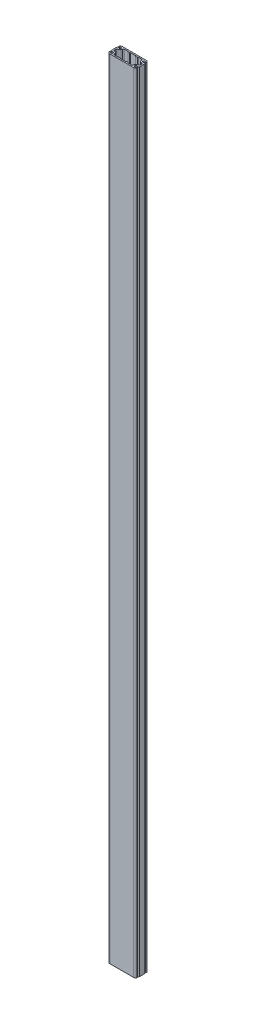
ISO-10303-21;
HEADER;
FILE_DESCRIPTION(('STEP AP214'),'2;1');
FILE_NAME('part.step','',(''),(''),'','','');
FILE_SCHEMA(('AUTOMOTIVE_DESIGN { 1 0 10303 214 1 1 1 1 }'));
ENDSEC;
DATA;
#1=APPLICATION_CONTEXT('core data for automotive mechanical design processes');
#2=APPLICATION_PROTOCOL_DEFINITION('international standard','automotive_design',2000,#1);
#3=PRODUCT_CONTEXT('',#1,'mechanical');
#4=PRODUCT('Part','Part','',(#3));
#5=PRODUCT_RELATED_PRODUCT_CATEGORY('part','',(#4));
#6=PRODUCT_DEFINITION_FORMATION('','',#4);
#7=PRODUCT_DEFINITION_CONTEXT('part definition',#1,'design');
#8=PRODUCT_DEFINITION('design','',#6,#7);
#9=PRODUCT_DEFINITION_SHAPE('','',#8);
#10=(LENGTH_UNIT() NAMED_UNIT(*) SI_UNIT(.MILLI.,.METRE.));
#11=(NAMED_UNIT(*) PLANE_ANGLE_UNIT() SI_UNIT($,.RADIAN.));
#12=(NAMED_UNIT(*) SI_UNIT($,.STERADIAN.) SOLID_ANGLE_UNIT());
#13=UNCERTAINTY_MEASURE_WITH_UNIT(LENGTH_MEASURE(1.E-05),#10,'distance_accuracy_value','');
#14=(GEOMETRIC_REPRESENTATION_CONTEXT(3) GLOBAL_UNCERTAINTY_ASSIGNED_CONTEXT((#13)) GLOBAL_UNIT_ASSIGNED_CONTEXT((#10,
#11,#12)) REPRESENTATION_CONTEXT('',''));
#15=CARTESIAN_POINT('',(0.,0.,0.));
#16=DIRECTION('',(0.,0.,1.));
#17=DIRECTION('',(1.,0.,0.));
#18=AXIS2_PLACEMENT_3D('',#15,#16,#17);
#19=CARTESIAN_POINT('',(84.6938611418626,5000.,-30.5717765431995));
#20=DIRECTION('',(0.,1.,0.));
#21=DIRECTION('',(0.,0.,1.));
#22=AXIS2_PLACEMENT_3D('',#19,#20,#21);
#23=PLANE('',#22);
#24=CARTESIAN_POINT('',(84.6938611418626,5000.,-30.5717765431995));
#25=DIRECTION('',(0.,1.,0.));
#26=DIRECTION('',(0.,0.,1.));
#27=AXIS2_PLACEMENT_3D('',#24,#25,#26);
#28=CIRCLE('',#27,3.99999999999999);
#29=CARTESIAN_POINT('',(81.1914378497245,5000.,-28.6396711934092));
#30=VERTEX_POINT('',#29);
#31=CARTESIAN_POINT('',(88.1962844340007,5000.,-32.5038818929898));
#32=VERTEX_POINT('',#31);
#33=EDGE_CURVE('E598',#30,#32,#28,.T.);
#34=ORIENTED_EDGE('',*,*,#33,.T.);
#35=CARTESIAN_POINT('',(75.5,5000.,-25.5));
#36=DIRECTION('',(0.,1.,0.));
#37=DIRECTION('',(0.,0.,1.));
#38=AXIS2_PLACEMENT_3D('',#35,#36,#37);
#39=CIRCLE('',#38,14.5);
#40=CARTESIAN_POINT('',(75.5,5000.,-40.));
#41=VERTEX_POINT('',#40);
#42=EDGE_CURVE('E601',#32,#41,#39,.T.);
#43=ORIENTED_EDGE('',*,*,#42,.T.);
#44=DIRECTION('',(-1.,0.,0.));
#45=VECTOR('',#44,1.);
#46=CARTESIAN_POINT('',(75.5,5000.,-40.));
#47=LINE('',#46,#45);
#48=CARTESIAN_POINT('',(-75.5,5000.,-40.));
#49=VERTEX_POINT('',#48);
#50=EDGE_CURVE('E604',#41,#49,#47,.T.);
#51=ORIENTED_EDGE('',*,*,#50,.T.);
#52=CARTESIAN_POINT('',(-75.5,5000.,-25.5));
#53=DIRECTION('',(0.,1.,0.));
#54=DIRECTION('',(0.,0.,-1.));
#55=AXIS2_PLACEMENT_3D('',#52,#53,#54);
#56=CIRCLE('',#55,14.5);
#57=CARTESIAN_POINT('',(-88.1962844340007,5000.,-32.5038818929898));
#58=VERTEX_POINT('',#57);
#59=EDGE_CURVE('E606',#49,#58,#56,.T.);
#60=ORIENTED_EDGE('',*,*,#59,.T.);
#61=CARTESIAN_POINT('',(-84.6938611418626,5000.,-30.5717765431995));
#62=DIRECTION('',(0.,1.,0.));
#63=DIRECTION('',(0.,0.,-1.));
#64=AXIS2_PLACEMENT_3D('',#61,#62,#63);
#65=CIRCLE('',#64,3.99999999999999);
#66=CARTESIAN_POINT('',(-81.1914378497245,5000.,-28.6396711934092));
#67=VERTEX_POINT('',#66);
#68=EDGE_CURVE('E608',#58,#67,#65,.T.);
#69=ORIENTED_EDGE('',*,*,#68,.T.);
#70=CARTESIAN_POINT('',(-75.5,5000.,-25.5));
#71=DIRECTION('',(0.,-1.,0.));
#72=DIRECTION('',(0.,0.,-1.));
#73=AXIS2_PLACEMENT_3D('',#70,#71,#72);
#74=CIRCLE('',#73,6.5);
#75=CARTESIAN_POINT('',(-79.7220192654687,5000.,-20.5578796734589));
#76=VERTEX_POINT('',#75);
#77=EDGE_CURVE('E610',#67,#76,#74,.T.);
#78=ORIENTED_EDGE('',*,*,#77,.T.);
#79=CARTESIAN_POINT('',(-83.7691890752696,5000.,-15.8204308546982));
#80=DIRECTION('',(0.,1.,0.));
#81=DIRECTION('',(0.,0.,-1.));
#82=AXIS2_PLACEMENT_3D('',#79,#80,#81);
#83=CIRCLE('',#82,6.23081092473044);
#84=CARTESIAN_POINT('',(-90.,5000.,-15.8204308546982));
#85=VERTEX_POINT('',#84);
#86=EDGE_CURVE('E612',#76,#85,#83,.T.);
#87=ORIENTED_EDGE('',*,*,#86,.T.);
#88=DIRECTION('',(0.,0.,1.));
#89=VECTOR('',#88,1.);
#90=CARTESIAN_POINT('',(-90.,5000.,15.8204308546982));
#91=LINE('',#90,#89);
#92=CARTESIAN_POINT('',(-90.,5000.,15.8204308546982));
#93=VERTEX_POINT('',#92);
#94=EDGE_CURVE('E614',#85,#93,#91,.T.);
#95=ORIENTED_EDGE('',*,*,#94,.T.);
#96=CARTESIAN_POINT('',(-83.7691890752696,5000.,15.8204308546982));
#97=DIRECTION('',(0.,1.,0.));
#98=DIRECTION('',(0.,0.,1.));
#99=AXIS2_PLACEMENT_3D('',#96,#97,#98);
#100=CIRCLE('',#99,6.23081092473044);
#101=CARTESIAN_POINT('',(-79.7220192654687,5000.,20.5578796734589));
#102=VERTEX_POINT('',#101);
#103=EDGE_CURVE('E616',#93,#102,#100,.T.);
#104=ORIENTED_EDGE('',*,*,#103,.T.);
#105=CARTESIAN_POINT('',(-75.5,5000.,25.5));
#106=DIRECTION('',(0.,-1.,0.));
#107=DIRECTION('',(0.,0.,1.));
#108=AXIS2_PLACEMENT_3D('',#105,#106,#107);
#109=CIRCLE('',#108,6.5);
#110=CARTESIAN_POINT('',(-81.1914378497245,5000.,28.6396711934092));
#111=VERTEX_POINT('',#110);
#112=EDGE_CURVE('E618',#102,#111,#109,.T.);
#113=ORIENTED_EDGE('',*,*,#112,.T.);
#114=CARTESIAN_POINT('',(-84.6938611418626,5000.,30.5717765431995));
#115=DIRECTION('',(0.,1.,0.));
#116=DIRECTION('',(0.,0.,1.));
#117=AXIS2_PLACEMENT_3D('',#114,#115,#116);
#118=CIRCLE('',#117,3.99999999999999);
#119=CARTESIAN_POINT('',(-88.1962844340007,5000.,32.5038818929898));
#120=VERTEX_POINT('',#119);
#121=EDGE_CURVE('E620',#111,#120,#118,.T.);
#122=ORIENTED_EDGE('',*,*,#121,.T.);
#123=CARTESIAN_POINT('',(-75.5,5000.,25.5));
#124=DIRECTION('',(0.,1.,0.));
#125=DIRECTION('',(0.,0.,1.));
#126=AXIS2_PLACEMENT_3D('',#123,#124,#125);
#127=CIRCLE('',#126,14.5);
#128=CARTESIAN_POINT('',(-75.5,5000.,40.));
#129=VERTEX_POINT('',#128);
#130=EDGE_CURVE('E622',#120,#129,#127,.T.);
#131=ORIENTED_EDGE('',*,*,#130,.T.);
#132=DIRECTION('',(1.,0.,0.));
#133=VECTOR('',#132,1.);
#134=CARTESIAN_POINT('',(75.5,5000.,40.));
#135=LINE('',#134,#133);
#136=CARTESIAN_POINT('',(75.5,5000.,40.));
#137=VERTEX_POINT('',#136);
#138=EDGE_CURVE('E624',#129,#137,#135,.T.);
#139=ORIENTED_EDGE('',*,*,#138,.T.);
#140=CARTESIAN_POINT('',(75.5,5000.,25.5));
#141=DIRECTION('',(0.,1.,0.));
#142=DIRECTION('',(0.,0.,-1.));
#143=AXIS2_PLACEMENT_3D('',#140,#141,#142);
#144=CIRCLE('',#143,14.5);
#145=CARTESIAN_POINT('',(88.1962844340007,5000.,32.5038818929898));
#146=VERTEX_POINT('',#145);
#147=EDGE_CURVE('E626',#137,#146,#144,.T.);
#148=ORIENTED_EDGE('',*,*,#147,.T.);
#149=CARTESIAN_POINT('',(84.6938611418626,5000.,30.5717765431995));
#150=DIRECTION('',(0.,1.,0.));
#151=DIRECTION('',(0.,0.,-1.));
#152=AXIS2_PLACEMENT_3D('',#149,#150,#151);
#153=CIRCLE('',#152,3.99999999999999);
#154=CARTESIAN_POINT('',(81.1914378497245,5000.,28.6396711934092));
#155=VERTEX_POINT('',#154);
#156=EDGE_CURVE('E628',#146,#155,#153,.T.);
#157=ORIENTED_EDGE('',*,*,#156,.T.);
#158=CARTESIAN_POINT('',(75.5,5000.,25.5));
#159=DIRECTION('',(0.,-1.,0.));
#160=DIRECTION('',(0.,0.,-1.));
#161=AXIS2_PLACEMENT_3D('',#158,#159,#160);
#162=CIRCLE('',#161,6.5);
#163=CARTESIAN_POINT('',(79.7220192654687,5000.,20.5578796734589));
#164=VERTEX_POINT('',#163);
#165=EDGE_CURVE('E630',#155,#164,#162,.T.);
#166=ORIENTED_EDGE('',*,*,#165,.T.);
#167=CARTESIAN_POINT('',(83.7691890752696,5000.,15.8204308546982));
#168=DIRECTION('',(0.,1.,0.));
#169=DIRECTION('',(0.,0.,-1.));
#170=AXIS2_PLACEMENT_3D('',#167,#168,#169);
#171=CIRCLE('',#170,6.23081092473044);
#172=CARTESIAN_POINT('',(90.,5000.,15.8204308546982));
#173=VERTEX_POINT('',#172);
#174=EDGE_CURVE('E632',#164,#173,#171,.T.);
#175=ORIENTED_EDGE('',*,*,#174,.T.);
#176=DIRECTION('',(0.,0.,-1.));
#177=VECTOR('',#176,1.);
#178=CARTESIAN_POINT('',(90.,5000.,15.8204308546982));
#179=LINE('',#178,#177);
#180=CARTESIAN_POINT('',(90.,5000.,-15.8204308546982));
#181=VERTEX_POINT('',#180);
#182=EDGE_CURVE('E634',#173,#181,#179,.T.);
#183=ORIENTED_EDGE('',*,*,#182,.T.);
#184=CARTESIAN_POINT('',(83.7691890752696,5000.,-15.8204308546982));
#185=DIRECTION('',(0.,1.,0.));
#186=DIRECTION('',(0.,0.,1.));
#187=AXIS2_PLACEMENT_3D('',#184,#185,#186);
#188=CIRCLE('',#187,6.23081092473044);
#189=CARTESIAN_POINT('',(79.7220192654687,5000.,-20.5578796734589));
#190=VERTEX_POINT('',#189);
#191=EDGE_CURVE('E636',#181,#190,#188,.T.);
#192=ORIENTED_EDGE('',*,*,#191,.T.);
#193=CARTESIAN_POINT('',(75.5,5000.,-25.5));
#194=DIRECTION('',(0.,-1.,0.));
#195=DIRECTION('',(0.,0.,1.));
#196=AXIS2_PLACEMENT_3D('',#193,#194,#195);
#197=CIRCLE('',#196,6.5);
#198=EDGE_CURVE('E638',#190,#30,#197,.T.);
#199=ORIENTED_EDGE('',*,*,#198,.T.);
#200=EDGE_LOOP('',(#34,#43,#51,#60,#69,#78,#87,#95,#104,#113,#122,#131,#139,#148,#157,#166,#175,
#183,#192,#199));
#201=FACE_BOUND('',#200,.T.);
#202=CARTESIAN_POINT('',(54.5,5000.,-25.5));
#203=DIRECTION('',(0.,1.,0.));
#204=DIRECTION('',(0.,0.,1.));
#205=AXIS2_PLACEMENT_3D('',#202,#203,#204);
#206=CIRCLE('',#205,6.5);
#207=CARTESIAN_POINT('',(61.,5000.,-25.5));
#208=VERTEX_POINT('',#207);
#209=CARTESIAN_POINT('',(54.5,5000.,-32.));
#210=VERTEX_POINT('',#209);
#211=EDGE_CURVE('E373',#208,#210,#206,.T.);
#212=ORIENTED_EDGE('',*,*,#211,.F.);
#213=CARTESIAN_POINT('',(75.5,5000.,-25.5));
#214=DIRECTION('',(0.,-1.,0.));
#215=DIRECTION('',(0.,0.,1.));
#216=AXIS2_PLACEMENT_3D('',#213,#214,#215);
#217=CIRCLE('',#216,14.5);
#218=CARTESIAN_POINT('',(75.5,5000.,-11.));
#219=VERTEX_POINT('',#218);
#220=EDGE_CURVE('E365',#219,#208,#217,.T.);
#221=ORIENTED_EDGE('',*,*,#220,.F.);
#222=CARTESIAN_POINT('',(75.5,5000.,-4.5));
#223=DIRECTION('',(0.,1.,0.));
#224=DIRECTION('',(0.,0.,1.));
#225=AXIS2_PLACEMENT_3D('',#222,#223,#224);
#226=CIRCLE('',#225,6.5);
#227=CARTESIAN_POINT('',(82.,5000.,-4.5));
#228=VERTEX_POINT('',#227);
#229=EDGE_CURVE('E446',#228,#219,#226,.T.);
#230=ORIENTED_EDGE('',*,*,#229,.F.);
#231=DIRECTION('',(0.,0.,-1.));
#232=VECTOR('',#231,1.);
#233=CARTESIAN_POINT('',(82.,5000.,-4.5));
#234=LINE('',#233,#232);
#235=CARTESIAN_POINT('',(82.,5000.,4.5));
#236=VERTEX_POINT('',#235);
#237=EDGE_CURVE('E444',#236,#228,#234,.T.);
#238=ORIENTED_EDGE('',*,*,#237,.F.);
#239=CARTESIAN_POINT('',(75.5,5000.,4.5));
#240=DIRECTION('',(0.,1.,0.));
#241=DIRECTION('',(0.,0.,-1.));
#242=AXIS2_PLACEMENT_3D('',#239,#240,#241);
#243=CIRCLE('',#242,6.5);
#244=CARTESIAN_POINT('',(75.5,5000.,11.));
#245=VERTEX_POINT('',#244);
#246=EDGE_CURVE('E442',#245,#236,#243,.T.);
#247=ORIENTED_EDGE('',*,*,#246,.F.);
#248=CARTESIAN_POINT('',(75.5,5000.,25.5));
#249=DIRECTION('',(0.,-1.,0.));
#250=DIRECTION('',(0.,0.,-1.));
#251=AXIS2_PLACEMENT_3D('',#248,#249,#250);
#252=CIRCLE('',#251,14.5);
#253=CARTESIAN_POINT('',(61.,5000.,25.5));
#254=VERTEX_POINT('',#253);
#255=EDGE_CURVE('E440',#254,#245,#252,.T.);
#256=ORIENTED_EDGE('',*,*,#255,.F.);
#257=CARTESIAN_POINT('',(54.5,5000.,25.5));
#258=DIRECTION('',(0.,1.,0.));
#259=DIRECTION('',(0.,0.,-1.));
#260=AXIS2_PLACEMENT_3D('',#257,#258,#259);
#261=CIRCLE('',#260,6.5);
#262=CARTESIAN_POINT('',(54.5,5000.,32.));
#263=VERTEX_POINT('',#262);
#264=EDGE_CURVE('E438',#263,#254,#261,.T.);
#265=ORIENTED_EDGE('',*,*,#264,.F.);
#266=DIRECTION('',(1.,0.,0.));
#267=VECTOR('',#266,1.);
#268=CARTESIAN_POINT('',(32.5172988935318,5000.,32.));
#269=LINE('',#268,#267);
#270=CARTESIAN_POINT('',(32.5172988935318,5000.,32.));
#271=VERTEX_POINT('',#270);
#272=EDGE_CURVE('E436',#271,#263,#269,.T.);
#273=ORIENTED_EDGE('',*,*,#272,.F.);
#274=DIRECTION('',(0.642787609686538,0.,0.766044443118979));
#275=VECTOR('',#274,1.);
#276=CARTESIAN_POINT('',(30.,5000.,29.));
#277=LINE('',#276,#275);
#278=CARTESIAN_POINT('',(30.,5000.,29.));
#279=VERTEX_POINT('',#278);
#280=EDGE_CURVE('E434',#279,#271,#277,.T.);
#281=ORIENTED_EDGE('',*,*,#280,.F.);
#282=DIRECTION('',(1.,0.,0.));
#283=VECTOR('',#282,1.);
#284=CARTESIAN_POINT('',(20.,5000.,29.));
#285=LINE('',#284,#283);
#286=CARTESIAN_POINT('',(20.,5000.,29.));
#287=VERTEX_POINT('',#286);
#288=EDGE_CURVE('E432',#287,#279,#285,.T.);
#289=ORIENTED_EDGE('',*,*,#288,.F.);
#290=DIRECTION('',(0.642787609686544,0.,-0.766044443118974));
#291=VECTOR('',#290,1.);
#292=CARTESIAN_POINT('',(20.,5000.,29.));
#293=LINE('',#292,#291);
#294=CARTESIAN_POINT('',(17.4827011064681,5000.,32.));
#295=VERTEX_POINT('',#294);
#296=EDGE_CURVE('E430',#295,#287,#293,.T.);
#297=ORIENTED_EDGE('',*,*,#296,.F.);
#298=DIRECTION('',(1.,0.,0.));
#299=VECTOR('',#298,1.);
#300=CARTESIAN_POINT('',(-17.4827011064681,5000.,32.));
#301=LINE('',#300,#299);
#302=CARTESIAN_POINT('',(-17.4827011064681,5000.,32.));
#303=VERTEX_POINT('',#302);
#304=EDGE_CURVE('E428',#303,#295,#301,.T.);
#305=ORIENTED_EDGE('',*,*,#304,.F.);
#306=DIRECTION('',(0.642787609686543,0.,0.766044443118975));
#307=VECTOR('',#306,1.);
#308=CARTESIAN_POINT('',(-20.,5000.,29.));
#309=LINE('',#308,#307);
#310=CARTESIAN_POINT('',(-20.,5000.,29.));
#311=VERTEX_POINT('',#310);
#312=EDGE_CURVE('E426',#311,#303,#309,.T.);
#313=ORIENTED_EDGE('',*,*,#312,.F.);
#314=DIRECTION('',(1.,0.,0.));
#315=VECTOR('',#314,1.);
#316=CARTESIAN_POINT('',(-20.,5000.,29.));
#317=LINE('',#316,#315);
#318=CARTESIAN_POINT('',(-30.,5000.,29.));
#319=VERTEX_POINT('',#318);
#320=EDGE_CURVE('E424',#319,#311,#317,.T.);
#321=ORIENTED_EDGE('',*,*,#320,.F.);
#322=DIRECTION('',(0.642787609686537,0.,-0.76604444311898));
#323=VECTOR('',#322,1.);
#324=CARTESIAN_POINT('',(-30.,5000.,29.));
#325=LINE('',#324,#323);
#326=CARTESIAN_POINT('',(-32.5172988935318,5000.,32.));
#327=VERTEX_POINT('',#326);
#328=EDGE_CURVE('E422',#327,#319,#325,.T.);
#329=ORIENTED_EDGE('',*,*,#328,.F.);
#330=DIRECTION('',(1.,0.,0.));
#331=VECTOR('',#330,1.);
#332=CARTESIAN_POINT('',(-32.5172988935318,5000.,32.));
#333=LINE('',#332,#331);
#334=CARTESIAN_POINT('',(-54.5,5000.,32.));
#335=VERTEX_POINT('',#334);
#336=EDGE_CURVE('E420',#335,#327,#333,.T.);
#337=ORIENTED_EDGE('',*,*,#336,.F.);
#338=CARTESIAN_POINT('',(-54.5,5000.,25.5));
#339=DIRECTION('',(0.,1.,0.));
#340=DIRECTION('',(0.,0.,1.));
#341=AXIS2_PLACEMENT_3D('',#338,#339,#340);
#342=CIRCLE('',#341,6.5);
#343=CARTESIAN_POINT('',(-61.,5000.,25.5));
#344=VERTEX_POINT('',#343);
#345=EDGE_CURVE('E418',#344,#335,#342,.T.);
#346=ORIENTED_EDGE('',*,*,#345,.F.);
#347=CARTESIAN_POINT('',(-75.5,5000.,25.5));
#348=DIRECTION('',(0.,-1.,0.));
#349=DIRECTION('',(0.,0.,1.));
#350=AXIS2_PLACEMENT_3D('',#347,#348,#349);
#351=CIRCLE('',#350,14.5);
#352=CARTESIAN_POINT('',(-75.5,5000.,11.));
#353=VERTEX_POINT('',#352);
#354=EDGE_CURVE('E416',#353,#344,#351,.T.);
#355=ORIENTED_EDGE('',*,*,#354,.F.);
#356=CARTESIAN_POINT('',(-75.5,5000.,4.5));
#357=DIRECTION('',(0.,1.,0.));
#358=DIRECTION('',(0.,0.,1.));
#359=AXIS2_PLACEMENT_3D('',#356,#357,#358);
#360=CIRCLE('',#359,6.5);
#361=CARTESIAN_POINT('',(-82.,5000.,4.5));
#362=VERTEX_POINT('',#361);
#363=EDGE_CURVE('E414',#362,#353,#360,.T.);
#364=ORIENTED_EDGE('',*,*,#363,.F.);
#365=DIRECTION('',(0.,0.,1.));
#366=VECTOR('',#365,1.);
#367=CARTESIAN_POINT('',(-82.,5000.,-4.5));
#368=LINE('',#367,#366);
#369=CARTESIAN_POINT('',(-82.,5000.,-4.5));
#370=VERTEX_POINT('',#369);
#371=EDGE_CURVE('E412',#370,#362,#368,.T.);
#372=ORIENTED_EDGE('',*,*,#371,.F.);
#373=CARTESIAN_POINT('',(-75.5,5000.,-4.5));
#374=DIRECTION('',(0.,1.,0.));
#375=DIRECTION('',(0.,0.,-1.));
#376=AXIS2_PLACEMENT_3D('',#373,#374,#375);
#377=CIRCLE('',#376,6.5);
#378=CARTESIAN_POINT('',(-75.5,5000.,-11.));
#379=VERTEX_POINT('',#378);
#380=EDGE_CURVE('E410',#379,#370,#377,.T.);
#381=ORIENTED_EDGE('',*,*,#380,.F.);
#382=CARTESIAN_POINT('',(-75.5,5000.,-25.5));
#383=DIRECTION('',(0.,-1.,0.));
#384=DIRECTION('',(0.,0.,-1.));
#385=AXIS2_PLACEMENT_3D('',#382,#383,#384);
#386=CIRCLE('',#385,14.5);
#387=CARTESIAN_POINT('',(-61.,5000.,-25.5));
#388=VERTEX_POINT('',#387);
#389=EDGE_CURVE('E408',#388,#379,#386,.T.);
#390=ORIENTED_EDGE('',*,*,#389,.F.);
#391=CARTESIAN_POINT('',(-54.5,5000.,-25.5));
#392=DIRECTION('',(0.,1.,0.));
#393=DIRECTION('',(0.,0.,-1.));
#394=AXIS2_PLACEMENT_3D('',#391,#392,#393);
#395=CIRCLE('',#394,6.5);
#396=CARTESIAN_POINT('',(-54.5,5000.,-32.));
#397=VERTEX_POINT('',#396);
#398=EDGE_CURVE('E406',#397,#388,#395,.T.);
#399=ORIENTED_EDGE('',*,*,#398,.F.);
#400=DIRECTION('',(-1.,0.,0.));
#401=VECTOR('',#400,1.);
#402=CARTESIAN_POINT('',(-32.5172988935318,5000.,-32.));
#403=LINE('',#402,#401);
#404=CARTESIAN_POINT('',(-32.5172988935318,5000.,-32.));
#405=VERTEX_POINT('',#404);
#406=EDGE_CURVE('E404',#405,#397,#403,.T.);
#407=ORIENTED_EDGE('',*,*,#406,.F.);
#408=DIRECTION('',(-0.642787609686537,0.,-0.76604444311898));
#409=VECTOR('',#408,1.);
#410=CARTESIAN_POINT('',(-30.,5000.,-29.));
#411=LINE('',#410,#409);
#412=CARTESIAN_POINT('',(-30.,5000.,-29.));
#413=VERTEX_POINT('',#412);
#414=EDGE_CURVE('E402',#413,#405,#411,.T.);
#415=ORIENTED_EDGE('',*,*,#414,.F.);
#416=DIRECTION('',(-1.,0.,0.));
#417=VECTOR('',#416,1.);
#418=CARTESIAN_POINT('',(-20.,5000.,-29.));
#419=LINE('',#418,#417);
#420=CARTESIAN_POINT('',(-20.,5000.,-29.));
#421=VERTEX_POINT('',#420);
#422=EDGE_CURVE('E400',#421,#413,#419,.T.);
#423=ORIENTED_EDGE('',*,*,#422,.F.);
#424=DIRECTION('',(-0.642787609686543,0.,0.766044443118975));
#425=VECTOR('',#424,1.);
#426=CARTESIAN_POINT('',(-20.,5000.,-29.));
#427=LINE('',#426,#425);
#428=CARTESIAN_POINT('',(-17.4827011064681,5000.,-32.));
#429=VERTEX_POINT('',#428);
#430=EDGE_CURVE('E398',#429,#421,#427,.T.);
#431=ORIENTED_EDGE('',*,*,#430,.F.);
#432=DIRECTION('',(-1.,0.,0.));
#433=VECTOR('',#432,1.);
#434=CARTESIAN_POINT('',(-17.4827011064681,5000.,-32.));
#435=LINE('',#434,#433);
#436=CARTESIAN_POINT('',(17.4827011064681,5000.,-32.));
#437=VERTEX_POINT('',#436);
#438=EDGE_CURVE('E396',#437,#429,#435,.T.);
#439=ORIENTED_EDGE('',*,*,#438,.F.);
#440=DIRECTION('',(-0.642787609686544,0.,-0.766044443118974));
#441=VECTOR('',#440,1.);
#442=CARTESIAN_POINT('',(20.,5000.,-29.));
#443=LINE('',#442,#441);
#444=CARTESIAN_POINT('',(20.,5000.,-29.));
#445=VERTEX_POINT('',#444);
#446=EDGE_CURVE('E394',#445,#437,#443,.T.);
#447=ORIENTED_EDGE('',*,*,#446,.F.);
#448=DIRECTION('',(-1.,0.,0.));
#449=VECTOR('',#448,1.);
#450=CARTESIAN_POINT('',(20.,5000.,-29.));
#451=LINE('',#450,#449);
#452=CARTESIAN_POINT('',(30.,5000.,-29.));
#453=VERTEX_POINT('',#452);
#454=EDGE_CURVE('E392',#453,#445,#451,.T.);
#455=ORIENTED_EDGE('',*,*,#454,.F.);
#456=DIRECTION('',(-0.642787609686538,0.,0.766044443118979));
#457=VECTOR('',#456,1.);
#458=CARTESIAN_POINT('',(30.,5000.,-29.));
#459=LINE('',#458,#457);
#460=CARTESIAN_POINT('',(32.5172988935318,5000.,-32.));
#461=VERTEX_POINT('',#460);
#462=EDGE_CURVE('E388',#461,#453,#459,.T.);
#463=ORIENTED_EDGE('',*,*,#462,.F.);
#464=DIRECTION('',(-1.,0.,0.));
#465=VECTOR('',#464,1.);
#466=CARTESIAN_POINT('',(32.5172988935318,5000.,-32.));
#467=LINE('',#466,#465);
#468=EDGE_CURVE('E386',#210,#461,#467,.T.);
#469=ORIENTED_EDGE('',*,*,#468,.F.);
#470=EDGE_LOOP('',(#212,#221,#230,#238,#247,#256,#265,#273,#281,#289,#297,#305,#313,#321,#329,
#337,#346,#355,#364,#372,#381,#390,#399,#407,#415,#423,#431,#439,#447,#455,#463,#469));
#471=FACE_BOUND('',#470,.T.);
#472=ADVANCED_FACE('F36',(#201,#471),#23,.T.);
#473=CARTESIAN_POINT('',(84.6938611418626,0.,-30.5717765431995));
#474=DIRECTION('',(0.,1.,0.));
#475=DIRECTION('',(0.,0.,1.));
#476=AXIS2_PLACEMENT_3D('',#473,#474,#475);
#477=PLANE('',#476);
#478=CARTESIAN_POINT('',(84.6938611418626,0.,-30.5717765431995));
#479=DIRECTION('',(0.,1.,0.));
#480=DIRECTION('',(0.,0.,1.));
#481=AXIS2_PLACEMENT_3D('',#478,#479,#480);
#482=CIRCLE('',#481,3.99999999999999);
#483=CARTESIAN_POINT('',(81.1914378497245,0.,-28.6396711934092));
#484=VERTEX_POINT('',#483);
#485=CARTESIAN_POINT('',(88.1962844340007,0.,-32.5038818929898));
#486=VERTEX_POINT('',#485);
#487=EDGE_CURVE('E381',#484,#486,#482,.T.);
#488=ORIENTED_EDGE('',*,*,#487,.F.);
#489=CARTESIAN_POINT('',(75.5,0.,-25.5));
#490=DIRECTION('',(0.,-1.,0.));
#491=DIRECTION('',(0.,0.,1.));
#492=AXIS2_PLACEMENT_3D('',#489,#490,#491);
#493=CIRCLE('',#492,6.5);
#494=CARTESIAN_POINT('',(79.7220192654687,0.,-20.5578796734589));
#495=VERTEX_POINT('',#494);
#496=EDGE_CURVE('E602',#495,#484,#493,.T.);
#497=ORIENTED_EDGE('',*,*,#496,.F.);
#498=CARTESIAN_POINT('',(83.7691890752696,0.,-15.8204308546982));
#499=DIRECTION('',(0.,1.,0.));
#500=DIRECTION('',(0.,0.,1.));
#501=AXIS2_PLACEMENT_3D('',#498,#499,#500);
#502=CIRCLE('',#501,6.23081092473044);
#503=CARTESIAN_POINT('',(90.,0.,-15.8204308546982));
#504=VERTEX_POINT('',#503);
#505=EDGE_CURVE('E677',#504,#495,#502,.T.);
#506=ORIENTED_EDGE('',*,*,#505,.F.);
#507=DIRECTION('',(0.,0.,-1.));
#508=VECTOR('',#507,1.);
#509=CARTESIAN_POINT('',(90.,0.,15.8204308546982));
#510=LINE('',#509,#508);
#511=CARTESIAN_POINT('',(90.,0.,15.8204308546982));
#512=VERTEX_POINT('',#511);
#513=EDGE_CURVE('E675',#512,#504,#510,.T.);
#514=ORIENTED_EDGE('',*,*,#513,.F.);
#515=CARTESIAN_POINT('',(83.7691890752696,0.,15.8204308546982));
#516=DIRECTION('',(0.,1.,0.));
#517=DIRECTION('',(0.,0.,-1.));
#518=AXIS2_PLACEMENT_3D('',#515,#516,#517);
#519=CIRCLE('',#518,6.23081092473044);
#520=CARTESIAN_POINT('',(79.7220192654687,0.,20.5578796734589));
#521=VERTEX_POINT('',#520);
#522=EDGE_CURVE('E673',#521,#512,#519,.T.);
#523=ORIENTED_EDGE('',*,*,#522,.F.);
#524=CARTESIAN_POINT('',(75.5,0.,25.5));
#525=DIRECTION('',(0.,-1.,0.));
#526=DIRECTION('',(0.,0.,-1.));
#527=AXIS2_PLACEMENT_3D('',#524,#525,#526);
#528=CIRCLE('',#527,6.5);
#529=CARTESIAN_POINT('',(81.1914378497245,0.,28.6396711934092));
#530=VERTEX_POINT('',#529);
#531=EDGE_CURVE('E671',#530,#521,#528,.T.);
#532=ORIENTED_EDGE('',*,*,#531,.F.);
#533=CARTESIAN_POINT('',(84.6938611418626,0.,30.5717765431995));
#534=DIRECTION('',(0.,1.,0.));
#535=DIRECTION('',(0.,0.,-1.));
#536=AXIS2_PLACEMENT_3D('',#533,#534,#535);
#537=CIRCLE('',#536,3.99999999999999);
#538=CARTESIAN_POINT('',(88.1962844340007,0.,32.5038818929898));
#539=VERTEX_POINT('',#538);
#540=EDGE_CURVE('E669',#539,#530,#537,.T.);
#541=ORIENTED_EDGE('',*,*,#540,.F.);
#542=CARTESIAN_POINT('',(75.5,0.,25.5));
#543=DIRECTION('',(0.,1.,0.));
#544=DIRECTION('',(0.,0.,-1.));
#545=AXIS2_PLACEMENT_3D('',#542,#543,#544);
#546=CIRCLE('',#545,14.5);
#547=CARTESIAN_POINT('',(75.5,0.,40.));
#548=VERTEX_POINT('',#547);
#549=EDGE_CURVE('E667',#548,#539,#546,.T.);
#550=ORIENTED_EDGE('',*,*,#549,.F.);
#551=DIRECTION('',(1.,0.,0.));
#552=VECTOR('',#551,1.);
#553=CARTESIAN_POINT('',(75.5,0.,40.));
#554=LINE('',#553,#552);
#555=CARTESIAN_POINT('',(-75.5,0.,40.));
#556=VERTEX_POINT('',#555);
#557=EDGE_CURVE('E665',#556,#548,#554,.T.);
#558=ORIENTED_EDGE('',*,*,#557,.F.);
#559=CARTESIAN_POINT('',(-75.5,0.,25.5));
#560=DIRECTION('',(0.,1.,0.));
#561=DIRECTION('',(0.,0.,1.));
#562=AXIS2_PLACEMENT_3D('',#559,#560,#561);
#563=CIRCLE('',#562,14.5);
#564=CARTESIAN_POINT('',(-88.1962844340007,0.,32.5038818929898));
#565=VERTEX_POINT('',#564);
#566=EDGE_CURVE('E663',#565,#556,#563,.T.);
#567=ORIENTED_EDGE('',*,*,#566,.F.);
#568=CARTESIAN_POINT('',(-84.6938611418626,0.,30.5717765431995));
#569=DIRECTION('',(0.,1.,0.));
#570=DIRECTION('',(0.,0.,1.));
#571=AXIS2_PLACEMENT_3D('',#568,#569,#570);
#572=CIRCLE('',#571,3.99999999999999);
#573=CARTESIAN_POINT('',(-81.1914378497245,0.,28.6396711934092));
#574=VERTEX_POINT('',#573);
#575=EDGE_CURVE('E661',#574,#565,#572,.T.);
#576=ORIENTED_EDGE('',*,*,#575,.F.);
#577=CARTESIAN_POINT('',(-75.5,0.,25.5));
#578=DIRECTION('',(0.,-1.,0.));
#579=DIRECTION('',(0.,0.,1.));
#580=AXIS2_PLACEMENT_3D('',#577,#578,#579);
#581=CIRCLE('',#580,6.5);
#582=CARTESIAN_POINT('',(-79.7220192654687,0.,20.5578796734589));
#583=VERTEX_POINT('',#582);
#584=EDGE_CURVE('E659',#583,#574,#581,.T.);
#585=ORIENTED_EDGE('',*,*,#584,.F.);
#586=CARTESIAN_POINT('',(-83.7691890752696,0.,15.8204308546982));
#587=DIRECTION('',(0.,1.,0.));
#588=DIRECTION('',(0.,0.,1.));
#589=AXIS2_PLACEMENT_3D('',#586,#587,#588);
#590=CIRCLE('',#589,6.23081092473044);
#591=CARTESIAN_POINT('',(-90.,0.,15.8204308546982));
#592=VERTEX_POINT('',#591);
#593=EDGE_CURVE('E657',#592,#583,#590,.T.);
#594=ORIENTED_EDGE('',*,*,#593,.F.);
#595=DIRECTION('',(0.,0.,1.));
#596=VECTOR('',#595,1.);
#597=CARTESIAN_POINT('',(-90.,0.,15.8204308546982));
#598=LINE('',#597,#596);
#599=CARTESIAN_POINT('',(-90.,0.,-15.8204308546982));
#600=VERTEX_POINT('',#599);
#601=EDGE_CURVE('E655',#600,#592,#598,.T.);
#602=ORIENTED_EDGE('',*,*,#601,.F.);
#603=CARTESIAN_POINT('',(-83.7691890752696,0.,-15.8204308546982));
#604=DIRECTION('',(0.,1.,0.));
#605=DIRECTION('',(0.,0.,-1.));
#606=AXIS2_PLACEMENT_3D('',#603,#604,#605);
#607=CIRCLE('',#606,6.23081092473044);
#608=CARTESIAN_POINT('',(-79.7220192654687,0.,-20.5578796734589));
#609=VERTEX_POINT('',#608);
#610=EDGE_CURVE('E653',#609,#600,#607,.T.);
#611=ORIENTED_EDGE('',*,*,#610,.F.);
#612=CARTESIAN_POINT('',(-75.5,0.,-25.5));
#613=DIRECTION('',(0.,-1.,0.));
#614=DIRECTION('',(0.,0.,-1.));
#615=AXIS2_PLACEMENT_3D('',#612,#613,#614);
#616=CIRCLE('',#615,6.5);
#617=CARTESIAN_POINT('',(-81.1914378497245,0.,-28.6396711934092));
#618=VERTEX_POINT('',#617);
#619=EDGE_CURVE('E651',#618,#609,#616,.T.);
#620=ORIENTED_EDGE('',*,*,#619,.F.);
#621=CARTESIAN_POINT('',(-84.6938611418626,0.,-30.5717765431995));
#622=DIRECTION('',(0.,1.,0.));
#623=DIRECTION('',(0.,0.,-1.));
#624=AXIS2_PLACEMENT_3D('',#621,#622,#623);
#625=CIRCLE('',#624,3.99999999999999);
#626=CARTESIAN_POINT('',(-88.1962844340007,0.,-32.5038818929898));
#627=VERTEX_POINT('',#626);
#628=EDGE_CURVE('E649',#627,#618,#625,.T.);
#629=ORIENTED_EDGE('',*,*,#628,.F.);
#630=CARTESIAN_POINT('',(-75.5,0.,-25.5));
#631=DIRECTION('',(0.,1.,0.));
#632=DIRECTION('',(0.,0.,-1.));
#633=AXIS2_PLACEMENT_3D('',#630,#631,#632);
#634=CIRCLE('',#633,14.5);
#635=CARTESIAN_POINT('',(-75.5,0.,-40.));
#636=VERTEX_POINT('',#635);
#637=EDGE_CURVE('E647',#636,#627,#634,.T.);
#638=ORIENTED_EDGE('',*,*,#637,.F.);
#639=DIRECTION('',(-1.,0.,0.));
#640=VECTOR('',#639,1.);
#641=CARTESIAN_POINT('',(75.5,0.,-40.));
#642=LINE('',#641,#640);
#643=CARTESIAN_POINT('',(75.5,0.,-40.));
#644=VERTEX_POINT('',#643);
#645=EDGE_CURVE('E645',#644,#636,#642,.T.);
#646=ORIENTED_EDGE('',*,*,#645,.F.);
#647=CARTESIAN_POINT('',(75.5,0.,-25.5));
#648=DIRECTION('',(0.,1.,0.));
#649=DIRECTION('',(0.,0.,1.));
#650=AXIS2_PLACEMENT_3D('',#647,#648,#649);
#651=CIRCLE('',#650,14.5);
#652=EDGE_CURVE('E643',#486,#644,#651,.T.);
#653=ORIENTED_EDGE('',*,*,#652,.F.);
#654=EDGE_LOOP('',(#488,#497,#506,#514,#523,#532,#541,#550,#558,#567,#576,#585,#594,#602,#611,
#620,#629,#638,#646,#653));
#655=FACE_BOUND('',#654,.T.);
#656=CARTESIAN_POINT('',(75.5,0.,-25.5));
#657=DIRECTION('',(0.,-1.,0.));
#658=DIRECTION('',(0.,0.,1.));
#659=AXIS2_PLACEMENT_3D('',#656,#657,#658);
#660=CIRCLE('',#659,14.5);
#661=CARTESIAN_POINT('',(75.5,0.,-11.));
#662=VERTEX_POINT('',#661);
#663=CARTESIAN_POINT('',(61.,0.,-25.5));
#664=VERTEX_POINT('',#663);
#665=EDGE_CURVE('E59',#662,#664,#660,.T.);
#666=ORIENTED_EDGE('',*,*,#665,.T.);
#667=CARTESIAN_POINT('',(54.5,0.,-25.5));
#668=DIRECTION('',(0.,1.,0.));
#669=DIRECTION('',(0.,0.,1.));
#670=AXIS2_PLACEMENT_3D('',#667,#668,#669);
#671=CIRCLE('',#670,6.5);
#672=CARTESIAN_POINT('',(54.5,0.,-32.));
#673=VERTEX_POINT('',#672);
#674=EDGE_CURVE('E380',#664,#673,#671,.T.);
#675=ORIENTED_EDGE('',*,*,#674,.T.);
#676=DIRECTION('',(-1.,0.,0.));
#677=VECTOR('',#676,1.);
#678=CARTESIAN_POINT('',(32.5172988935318,0.,-32.));
#679=LINE('',#678,#677);
#680=CARTESIAN_POINT('',(32.5172988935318,0.,-32.));
#681=VERTEX_POINT('',#680);
#682=EDGE_CURVE('E450',#673,#681,#679,.T.);
#683=ORIENTED_EDGE('',*,*,#682,.T.);
#684=DIRECTION('',(-0.642787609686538,0.,0.766044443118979));
#685=VECTOR('',#684,1.);
#686=CARTESIAN_POINT('',(30.,0.,-29.));
#687=LINE('',#686,#685);
#688=CARTESIAN_POINT('',(30.,0.,-29.));
#689=VERTEX_POINT('',#688);
#690=EDGE_CURVE('E453',#681,#689,#687,.T.);
#691=ORIENTED_EDGE('',*,*,#690,.T.);
#692=DIRECTION('',(-1.,0.,0.));
#693=VECTOR('',#692,1.);
#694=CARTESIAN_POINT('',(20.,0.,-29.));
#695=LINE('',#694,#693);
#696=CARTESIAN_POINT('',(20.,0.,-29.));
#697=VERTEX_POINT('',#696);
#698=EDGE_CURVE('E456',#689,#697,#695,.T.);
#699=ORIENTED_EDGE('',*,*,#698,.T.);
#700=DIRECTION('',(-0.642787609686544,0.,-0.766044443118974));
#701=VECTOR('',#700,1.);
#702=CARTESIAN_POINT('',(20.,0.,-29.));
#703=LINE('',#702,#701);
#704=CARTESIAN_POINT('',(17.4827011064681,0.,-32.));
#705=VERTEX_POINT('',#704);
#706=EDGE_CURVE('E459',#697,#705,#703,.T.);
#707=ORIENTED_EDGE('',*,*,#706,.T.);
#708=DIRECTION('',(-1.,0.,0.));
#709=VECTOR('',#708,1.);
#710=CARTESIAN_POINT('',(-17.4827011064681,0.,-32.));
#711=LINE('',#710,#709);
#712=CARTESIAN_POINT('',(-17.4827011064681,0.,-32.));
#713=VERTEX_POINT('',#712);
#714=EDGE_CURVE('E462',#705,#713,#711,.T.);
#715=ORIENTED_EDGE('',*,*,#714,.T.);
#716=DIRECTION('',(-0.642787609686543,0.,0.766044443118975));
#717=VECTOR('',#716,1.);
#718=CARTESIAN_POINT('',(-20.,0.,-29.));
#719=LINE('',#718,#717);
#720=CARTESIAN_POINT('',(-20.,0.,-29.));
#721=VERTEX_POINT('',#720);
#722=EDGE_CURVE('E465',#713,#721,#719,.T.);
#723=ORIENTED_EDGE('',*,*,#722,.T.);
#724=DIRECTION('',(-1.,0.,0.));
#725=VECTOR('',#724,1.);
#726=CARTESIAN_POINT('',(-20.,0.,-29.));
#727=LINE('',#726,#725);
#728=CARTESIAN_POINT('',(-30.,0.,-29.));
#729=VERTEX_POINT('',#728);
#730=EDGE_CURVE('E468',#721,#729,#727,.T.);
#731=ORIENTED_EDGE('',*,*,#730,.T.);
#732=DIRECTION('',(-0.642787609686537,0.,-0.76604444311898));
#733=VECTOR('',#732,1.);
#734=CARTESIAN_POINT('',(-30.,0.,-29.));
#735=LINE('',#734,#733);
#736=CARTESIAN_POINT('',(-32.5172988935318,0.,-32.));
#737=VERTEX_POINT('',#736);
#738=EDGE_CURVE('E471',#729,#737,#735,.T.);
#739=ORIENTED_EDGE('',*,*,#738,.T.);
#740=DIRECTION('',(-1.,0.,0.));
#741=VECTOR('',#740,1.);
#742=CARTESIAN_POINT('',(-32.5172988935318,0.,-32.));
#743=LINE('',#742,#741);
#744=CARTESIAN_POINT('',(-54.5,0.,-32.));
#745=VERTEX_POINT('',#744);
#746=EDGE_CURVE('E474',#737,#745,#743,.T.);
#747=ORIENTED_EDGE('',*,*,#746,.T.);
#748=CARTESIAN_POINT('',(-54.5,0.,-25.5));
#749=DIRECTION('',(0.,1.,0.));
#750=DIRECTION('',(0.,0.,-1.));
#751=AXIS2_PLACEMENT_3D('',#748,#749,#750);
#752=CIRCLE('',#751,6.5);
#753=CARTESIAN_POINT('',(-61.,0.,-25.5));
#754=VERTEX_POINT('',#753);
#755=EDGE_CURVE('E477',#745,#754,#752,.T.);
#756=ORIENTED_EDGE('',*,*,#755,.T.);
#757=CARTESIAN_POINT('',(-75.5,0.,-25.5));
#758=DIRECTION('',(0.,-1.,0.));
#759=DIRECTION('',(0.,0.,-1.));
#760=AXIS2_PLACEMENT_3D('',#757,#758,#759);
#761=CIRCLE('',#760,14.5);
#762=CARTESIAN_POINT('',(-75.5,0.,-11.));
#763=VERTEX_POINT('',#762);
#764=EDGE_CURVE('E480',#754,#763,#761,.T.);
#765=ORIENTED_EDGE('',*,*,#764,.T.);
#766=CARTESIAN_POINT('',(-75.5,0.,-4.5));
#767=DIRECTION('',(0.,1.,0.));
#768=DIRECTION('',(0.,0.,-1.));
#769=AXIS2_PLACEMENT_3D('',#766,#767,#768);
#770=CIRCLE('',#769,6.5);
#771=CARTESIAN_POINT('',(-82.,0.,-4.5));
#772=VERTEX_POINT('',#771);
#773=EDGE_CURVE('E483',#763,#772,#770,.T.);
#774=ORIENTED_EDGE('',*,*,#773,.T.);
#775=DIRECTION('',(0.,0.,1.));
#776=VECTOR('',#775,1.);
#777=CARTESIAN_POINT('',(-82.,0.,-4.5));
#778=LINE('',#777,#776);
#779=CARTESIAN_POINT('',(-82.,0.,4.5));
#780=VERTEX_POINT('',#779);
#781=EDGE_CURVE('E486',#772,#780,#778,.T.);
#782=ORIENTED_EDGE('',*,*,#781,.T.);
#783=CARTESIAN_POINT('',(-75.5,0.,4.5));
#784=DIRECTION('',(0.,1.,0.));
#785=DIRECTION('',(0.,0.,1.));
#786=AXIS2_PLACEMENT_3D('',#783,#784,#785);
#787=CIRCLE('',#786,6.5);
#788=CARTESIAN_POINT('',(-75.5,0.,11.));
#789=VERTEX_POINT('',#788);
#790=EDGE_CURVE('E489',#780,#789,#787,.T.);
#791=ORIENTED_EDGE('',*,*,#790,.T.);
#792=CARTESIAN_POINT('',(-75.5,0.,25.5));
#793=DIRECTION('',(0.,-1.,0.));
#794=DIRECTION('',(0.,0.,1.));
#795=AXIS2_PLACEMENT_3D('',#792,#793,#794);
#796=CIRCLE('',#795,14.5);
#797=CARTESIAN_POINT('',(-61.,0.,25.5));
#798=VERTEX_POINT('',#797);
#799=EDGE_CURVE('E492',#789,#798,#796,.T.);
#800=ORIENTED_EDGE('',*,*,#799,.T.);
#801=CARTESIAN_POINT('',(-54.5,0.,25.5));
#802=DIRECTION('',(0.,1.,0.));
#803=DIRECTION('',(0.,0.,1.));
#804=AXIS2_PLACEMENT_3D('',#801,#802,#803);
#805=CIRCLE('',#804,6.5);
#806=CARTESIAN_POINT('',(-54.5,0.,32.));
#807=VERTEX_POINT('',#806);
#808=EDGE_CURVE('E495',#798,#807,#805,.T.);
#809=ORIENTED_EDGE('',*,*,#808,.T.);
#810=DIRECTION('',(1.,0.,0.));
#811=VECTOR('',#810,1.);
#812=CARTESIAN_POINT('',(-32.5172988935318,0.,32.));
#813=LINE('',#812,#811);
#814=CARTESIAN_POINT('',(-32.5172988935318,0.,32.));
#815=VERTEX_POINT('',#814);
#816=EDGE_CURVE('E498',#807,#815,#813,.T.);
#817=ORIENTED_EDGE('',*,*,#816,.T.);
#818=DIRECTION('',(0.642787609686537,0.,-0.76604444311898));
#819=VECTOR('',#818,1.);
#820=CARTESIAN_POINT('',(-30.,0.,29.));
#821=LINE('',#820,#819);
#822=CARTESIAN_POINT('',(-30.,0.,29.));
#823=VERTEX_POINT('',#822);
#824=EDGE_CURVE('E501',#815,#823,#821,.T.);
#825=ORIENTED_EDGE('',*,*,#824,.T.);
#826=DIRECTION('',(1.,0.,0.));
#827=VECTOR('',#826,1.);
#828=CARTESIAN_POINT('',(-20.,0.,29.));
#829=LINE('',#828,#827);
#830=CARTESIAN_POINT('',(-20.,0.,29.));
#831=VERTEX_POINT('',#830);
#832=EDGE_CURVE('E504',#823,#831,#829,.T.);
#833=ORIENTED_EDGE('',*,*,#832,.T.);
#834=DIRECTION('',(0.642787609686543,0.,0.766044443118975));
#835=VECTOR('',#834,1.);
#836=CARTESIAN_POINT('',(-20.,0.,29.));
#837=LINE('',#836,#835);
#838=CARTESIAN_POINT('',(-17.4827011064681,0.,32.));
#839=VERTEX_POINT('',#838);
#840=EDGE_CURVE('E507',#831,#839,#837,.T.);
#841=ORIENTED_EDGE('',*,*,#840,.T.);
#842=DIRECTION('',(1.,0.,0.));
#843=VECTOR('',#842,1.);
#844=CARTESIAN_POINT('',(-17.4827011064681,0.,32.));
#845=LINE('',#844,#843);
#846=CARTESIAN_POINT('',(17.4827011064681,0.,32.));
#847=VERTEX_POINT('',#846);
#848=EDGE_CURVE('E510',#839,#847,#845,.T.);
#849=ORIENTED_EDGE('',*,*,#848,.T.);
#850=DIRECTION('',(0.642787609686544,0.,-0.766044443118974));
#851=VECTOR('',#850,1.);
#852=CARTESIAN_POINT('',(20.,0.,29.));
#853=LINE('',#852,#851);
#854=CARTESIAN_POINT('',(20.,0.,29.));
#855=VERTEX_POINT('',#854);
#856=EDGE_CURVE('E513',#847,#855,#853,.T.);
#857=ORIENTED_EDGE('',*,*,#856,.T.);
#858=DIRECTION('',(1.,0.,0.));
#859=VECTOR('',#858,1.);
#860=CARTESIAN_POINT('',(20.,0.,29.));
#861=LINE('',#860,#859);
#862=CARTESIAN_POINT('',(30.,0.,29.));
#863=VERTEX_POINT('',#862);
#864=EDGE_CURVE('E516',#855,#863,#861,.T.);
#865=ORIENTED_EDGE('',*,*,#864,.T.);
#866=DIRECTION('',(0.642787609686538,0.,0.766044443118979));
#867=VECTOR('',#866,1.);
#868=CARTESIAN_POINT('',(30.,0.,29.));
#869=LINE('',#868,#867);
#870=CARTESIAN_POINT('',(32.5172988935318,0.,32.));
#871=VERTEX_POINT('',#870);
#872=EDGE_CURVE('E519',#863,#871,#869,.T.);
#873=ORIENTED_EDGE('',*,*,#872,.T.);
#874=DIRECTION('',(1.,0.,0.));
#875=VECTOR('',#874,1.);
#876=CARTESIAN_POINT('',(32.5172988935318,0.,32.));
#877=LINE('',#876,#875);
#878=CARTESIAN_POINT('',(54.5,0.,32.));
#879=VERTEX_POINT('',#878);
#880=EDGE_CURVE('E522',#871,#879,#877,.T.);
#881=ORIENTED_EDGE('',*,*,#880,.T.);
#882=CARTESIAN_POINT('',(54.5,0.,25.5));
#883=DIRECTION('',(0.,1.,0.));
#884=DIRECTION('',(0.,0.,-1.));
#885=AXIS2_PLACEMENT_3D('',#882,#883,#884);
#886=CIRCLE('',#885,6.5);
#887=CARTESIAN_POINT('',(61.,0.,25.5));
#888=VERTEX_POINT('',#887);
#889=EDGE_CURVE('E525',#879,#888,#886,.T.);
#890=ORIENTED_EDGE('',*,*,#889,.T.);
#891=CARTESIAN_POINT('',(75.5,0.,25.5));
#892=DIRECTION('',(0.,-1.,0.));
#893=DIRECTION('',(0.,0.,-1.));
#894=AXIS2_PLACEMENT_3D('',#891,#892,#893);
#895=CIRCLE('',#894,14.5);
#896=CARTESIAN_POINT('',(75.5,0.,11.));
#897=VERTEX_POINT('',#896);
#898=EDGE_CURVE('E528',#888,#897,#895,.T.);
#899=ORIENTED_EDGE('',*,*,#898,.T.);
#900=CARTESIAN_POINT('',(75.5,0.,4.5));
#901=DIRECTION('',(0.,1.,0.));
#902=DIRECTION('',(0.,0.,-1.));
#903=AXIS2_PLACEMENT_3D('',#900,#901,#902);
#904=CIRCLE('',#903,6.5);
#905=CARTESIAN_POINT('',(82.,0.,4.5));
#906=VERTEX_POINT('',#905);
#907=EDGE_CURVE('E531',#897,#906,#904,.T.);
#908=ORIENTED_EDGE('',*,*,#907,.T.);
#909=DIRECTION('',(0.,0.,-1.));
#910=VECTOR('',#909,1.);
#911=CARTESIAN_POINT('',(82.,0.,-4.5));
#912=LINE('',#911,#910);
#913=CARTESIAN_POINT('',(82.,0.,-4.5));
#914=VERTEX_POINT('',#913);
#915=EDGE_CURVE('E534',#906,#914,#912,.T.);
#916=ORIENTED_EDGE('',*,*,#915,.T.);
#917=CARTESIAN_POINT('',(75.5,0.,-4.5));
#918=DIRECTION('',(0.,1.,0.));
#919=DIRECTION('',(0.,0.,1.));
#920=AXIS2_PLACEMENT_3D('',#917,#918,#919);
#921=CIRCLE('',#920,6.5);
#922=EDGE_CURVE('E374',#914,#662,#921,.T.);
#923=ORIENTED_EDGE('',*,*,#922,.T.);
#924=EDGE_LOOP('',(#666,#675,#683,#691,#699,#707,#715,#723,#731,#739,#747,#756,#765,#774,#782,
#791,#800,#809,#817,#825,#833,#841,#849,#857,#865,#873,#881,#890,#899,#908,#916,#923));
#925=FACE_BOUND('',#924,.T.);
#926=ADVANCED_FACE('F743',(#655,#925),#477,.F.);
#927=CARTESIAN_POINT('',(84.6938611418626,5000.,-30.5717765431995));
#928=DIRECTION('',(0.,-1.,0.));
#929=DIRECTION('',(0.,0.,-1.));
#930=AXIS2_PLACEMENT_3D('',#927,#928,#929);
#931=CYLINDRICAL_SURFACE('',#930,3.99999999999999);
#932=ORIENTED_EDGE('',*,*,#487,.T.);
#933=DIRECTION('',(0.,-1.,0.));
#934=VECTOR('',#933,1.);
#935=CARTESIAN_POINT('',(88.1962844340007,5000.,-32.5038818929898));
#936=LINE('',#935,#934);
#937=EDGE_CURVE('E11',#32,#486,#936,.T.);
#938=ORIENTED_EDGE('',*,*,#937,.F.);
#939=ORIENTED_EDGE('',*,*,#33,.F.);
#940=DIRECTION('',(0.,-1.,0.));
#941=VECTOR('',#940,1.);
#942=CARTESIAN_POINT('',(81.1914378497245,5000.,-28.6396711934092));
#943=LINE('',#942,#941);
#944=EDGE_CURVE('E640',#30,#484,#943,.T.);
#945=ORIENTED_EDGE('',*,*,#944,.T.);
#946=EDGE_LOOP('',(#932,#938,#939,#945));
#947=FACE_BOUND('',#946,.T.);
#948=ADVANCED_FACE('F38',(#947),#931,.T.);
#949=CARTESIAN_POINT('',(75.5,5000.,-25.5));
#950=DIRECTION('',(0.,-1.,0.));
#951=DIRECTION('',(0.,0.,-1.));
#952=AXIS2_PLACEMENT_3D('',#949,#950,#951);
#953=CYLINDRICAL_SURFACE('',#952,14.5);
#954=ORIENTED_EDGE('',*,*,#652,.T.);
#955=DIRECTION('',(0.,-1.,0.));
#956=VECTOR('',#955,1.);
#957=CARTESIAN_POINT('',(75.5,5000.,-40.));
#958=LINE('',#957,#956);
#959=EDGE_CURVE('E44',#41,#644,#958,.T.);
#960=ORIENTED_EDGE('',*,*,#959,.F.);
#961=ORIENTED_EDGE('',*,*,#42,.F.);
#962=ORIENTED_EDGE('',*,*,#937,.T.);
#963=EDGE_LOOP('',(#954,#960,#961,#962));
#964=FACE_BOUND('',#963,.T.);
#965=ADVANCED_FACE('F760',(#964),#953,.T.);
#966=CARTESIAN_POINT('',(75.5,5000.,-40.));
#967=DIRECTION('',(0.,0.,1.));
#968=DIRECTION('',(1.,0.,0.));
#969=AXIS2_PLACEMENT_3D('',#966,#967,#968);
#970=PLANE('',#969);
#971=ORIENTED_EDGE('',*,*,#645,.T.);
#972=DIRECTION('',(0.,-1.,0.));
#973=VECTOR('',#972,1.);
#974=CARTESIAN_POINT('',(-75.5,5000.,-40.));
#975=LINE('',#974,#973);
#976=EDGE_CURVE('E730',#49,#636,#975,.T.);
#977=ORIENTED_EDGE('',*,*,#976,.F.);
#978=ORIENTED_EDGE('',*,*,#50,.F.);
#979=ORIENTED_EDGE('',*,*,#959,.T.);
#980=EDGE_LOOP('',(#971,#977,#978,#979));
#981=FACE_BOUND('',#980,.T.);
#982=ADVANCED_FACE('F737',(#981),#970,.F.);
#983=CARTESIAN_POINT('',(-75.5,5000.,-25.5));
#984=DIRECTION('',(0.,-1.,0.));
#985=DIRECTION('',(0.,0.,-1.));
#986=AXIS2_PLACEMENT_3D('',#983,#984,#985);
#987=CYLINDRICAL_SURFACE('',#986,14.5);
#988=ORIENTED_EDGE('',*,*,#637,.T.);
#989=DIRECTION('',(0.,-1.,0.));
#990=VECTOR('',#989,1.);
#991=CARTESIAN_POINT('',(-88.1962844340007,5000.,-32.5038818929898));
#992=LINE('',#991,#990);
#993=EDGE_CURVE('E727',#58,#627,#992,.T.);
#994=ORIENTED_EDGE('',*,*,#993,.F.);
#995=ORIENTED_EDGE('',*,*,#59,.F.);
#996=ORIENTED_EDGE('',*,*,#976,.T.);
#997=EDGE_LOOP('',(#988,#994,#995,#996));
#998=FACE_BOUND('',#997,.T.);
#999=ADVANCED_FACE('F749',(#998),#987,.T.);
#1000=CARTESIAN_POINT('',(-84.6938611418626,5000.,-30.5717765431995));
#1001=DIRECTION('',(0.,-1.,0.));
#1002=DIRECTION('',(0.,0.,-1.));
#1003=AXIS2_PLACEMENT_3D('',#1000,#1001,#1002);
#1004=CYLINDRICAL_SURFACE('',#1003,3.99999999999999);
#1005=ORIENTED_EDGE('',*,*,#628,.T.);
#1006=DIRECTION('',(0.,-1.,0.));
#1007=VECTOR('',#1006,1.);
#1008=CARTESIAN_POINT('',(-81.1914378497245,5000.,-28.6396711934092));
#1009=LINE('',#1008,#1007);
#1010=EDGE_CURVE('E724',#67,#618,#1009,.T.);
#1011=ORIENTED_EDGE('',*,*,#1010,.F.);
#1012=ORIENTED_EDGE('',*,*,#68,.F.);
#1013=ORIENTED_EDGE('',*,*,#993,.T.);
#1014=EDGE_LOOP('',(#1005,#1011,#1012,#1013));
#1015=FACE_BOUND('',#1014,.T.);
#1016=ADVANCED_FACE('F753',(#1015),#1004,.T.);
#1017=CARTESIAN_POINT('',(-75.5,5000.,-25.5));
#1018=DIRECTION('',(0.,-1.,0.));
#1019=DIRECTION('',(0.,0.,-1.));
#1020=AXIS2_PLACEMENT_3D('',#1017,#1018,#1019);
#1021=CYLINDRICAL_SURFACE('',#1020,6.5);
#1022=ORIENTED_EDGE('',*,*,#619,.T.);
#1023=DIRECTION('',(0.,-1.,0.));
#1024=VECTOR('',#1023,1.);
#1025=CARTESIAN_POINT('',(-79.7220192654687,5000.,-20.5578796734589));
#1026=LINE('',#1025,#1024);
#1027=EDGE_CURVE('E721',#76,#609,#1026,.T.);
#1028=ORIENTED_EDGE('',*,*,#1027,.F.);
#1029=ORIENTED_EDGE('',*,*,#77,.F.);
#1030=ORIENTED_EDGE('',*,*,#1010,.T.);
#1031=EDGE_LOOP('',(#1022,#1028,#1029,#1030));
#1032=FACE_BOUND('',#1031,.T.);
#1033=ADVANCED_FACE('F833',(#1032),#1021,.F.);
#1034=CARTESIAN_POINT('',(-83.7691890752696,5000.,-15.8204308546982));
#1035=DIRECTION('',(0.,-1.,0.));
#1036=DIRECTION('',(0.,0.,-1.));
#1037=AXIS2_PLACEMENT_3D('',#1034,#1035,#1036);
#1038=CYLINDRICAL_SURFACE('',#1037,6.23081092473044);
#1039=ORIENTED_EDGE('',*,*,#610,.T.);
#1040=DIRECTION('',(0.,-1.,0.));
#1041=VECTOR('',#1040,1.);
#1042=CARTESIAN_POINT('',(-90.,5000.,-15.8204308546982));
#1043=LINE('',#1042,#1041);
#1044=EDGE_CURVE('E718',#85,#600,#1043,.T.);
#1045=ORIENTED_EDGE('',*,*,#1044,.F.);
#1046=ORIENTED_EDGE('',*,*,#86,.F.);
#1047=ORIENTED_EDGE('',*,*,#1027,.T.);
#1048=EDGE_LOOP('',(#1039,#1045,#1046,#1047));
#1049=FACE_BOUND('',#1048,.T.);
#1050=ADVANCED_FACE('F831',(#1049),#1038,.T.);
#1051=CARTESIAN_POINT('',(-90.,5000.,15.8204308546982));
#1052=DIRECTION('',(1.,0.,0.));
#1053=DIRECTION('',(0.,0.,-1.));
#1054=AXIS2_PLACEMENT_3D('',#1051,#1052,#1053);
#1055=PLANE('',#1054);
#1056=ORIENTED_EDGE('',*,*,#601,.T.);
#1057=DIRECTION('',(0.,-1.,0.));
#1058=VECTOR('',#1057,1.);
#1059=CARTESIAN_POINT('',(-90.,5000.,15.8204308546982));
#1060=LINE('',#1059,#1058);
#1061=EDGE_CURVE('E715',#93,#592,#1060,.T.);
#1062=ORIENTED_EDGE('',*,*,#1061,.F.);
#1063=ORIENTED_EDGE('',*,*,#94,.F.);
#1064=ORIENTED_EDGE('',*,*,#1044,.T.);
#1065=EDGE_LOOP('',(#1056,#1062,#1063,#1064));
#1066=FACE_BOUND('',#1065,.T.);
#1067=ADVANCED_FACE('F826',(#1066),#1055,.F.);
#1068=CARTESIAN_POINT('',(-83.7691890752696,5000.,15.8204308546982));
#1069=DIRECTION('',(0.,-1.,0.));
#1070=DIRECTION('',(0.,0.,-1.));
#1071=AXIS2_PLACEMENT_3D('',#1068,#1069,#1070);
#1072=CYLINDRICAL_SURFACE('',#1071,6.23081092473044);
#1073=ORIENTED_EDGE('',*,*,#593,.T.);
#1074=DIRECTION('',(0.,-1.,0.));
#1075=VECTOR('',#1074,1.);
#1076=CARTESIAN_POINT('',(-79.7220192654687,5000.,20.5578796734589));
#1077=LINE('',#1076,#1075);
#1078=EDGE_CURVE('E712',#102,#583,#1077,.T.);
#1079=ORIENTED_EDGE('',*,*,#1078,.F.);
#1080=ORIENTED_EDGE('',*,*,#103,.F.);
#1081=ORIENTED_EDGE('',*,*,#1061,.T.);
#1082=EDGE_LOOP('',(#1073,#1079,#1080,#1081));
#1083=FACE_BOUND('',#1082,.T.);
#1084=ADVANCED_FACE('F821',(#1083),#1072,.T.);
#1085=CARTESIAN_POINT('',(-75.5,5000.,25.5));
#1086=DIRECTION('',(0.,-1.,0.));
#1087=DIRECTION('',(0.,0.,-1.));
#1088=AXIS2_PLACEMENT_3D('',#1085,#1086,#1087);
#1089=CYLINDRICAL_SURFACE('',#1088,6.5);
#1090=ORIENTED_EDGE('',*,*,#584,.T.);
#1091=DIRECTION('',(0.,-1.,0.));
#1092=VECTOR('',#1091,1.);
#1093=CARTESIAN_POINT('',(-81.1914378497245,5000.,28.6396711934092));
#1094=LINE('',#1093,#1092);
#1095=EDGE_CURVE('E709',#111,#574,#1094,.T.);
#1096=ORIENTED_EDGE('',*,*,#1095,.F.);
#1097=ORIENTED_EDGE('',*,*,#112,.F.);
#1098=ORIENTED_EDGE('',*,*,#1078,.T.);
#1099=EDGE_LOOP('',(#1090,#1096,#1097,#1098));
#1100=FACE_BOUND('',#1099,.T.);
#1101=ADVANCED_FACE('F817',(#1100),#1089,.F.);
#1102=CARTESIAN_POINT('',(-84.6938611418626,5000.,30.5717765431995));
#1103=DIRECTION('',(0.,-1.,0.));
#1104=DIRECTION('',(0.,0.,-1.));
#1105=AXIS2_PLACEMENT_3D('',#1102,#1103,#1104);
#1106=CYLINDRICAL_SURFACE('',#1105,3.99999999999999);
#1107=ORIENTED_EDGE('',*,*,#575,.T.);
#1108=DIRECTION('',(0.,-1.,0.));
#1109=VECTOR('',#1108,1.);
#1110=CARTESIAN_POINT('',(-88.1962844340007,5000.,32.5038818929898));
#1111=LINE('',#1110,#1109);
#1112=EDGE_CURVE('E706',#120,#565,#1111,.T.);
#1113=ORIENTED_EDGE('',*,*,#1112,.F.);
#1114=ORIENTED_EDGE('',*,*,#121,.F.);
#1115=ORIENTED_EDGE('',*,*,#1095,.T.);
#1116=EDGE_LOOP('',(#1107,#1113,#1114,#1115));
#1117=FACE_BOUND('',#1116,.T.);
#1118=ADVANCED_FACE('F812',(#1117),#1106,.T.);
#1119=CARTESIAN_POINT('',(-75.5,5000.,25.5));
#1120=DIRECTION('',(0.,-1.,0.));
#1121=DIRECTION('',(0.,0.,-1.));
#1122=AXIS2_PLACEMENT_3D('',#1119,#1120,#1121);
#1123=CYLINDRICAL_SURFACE('',#1122,14.5);
#1124=ORIENTED_EDGE('',*,*,#566,.T.);
#1125=DIRECTION('',(0.,-1.,0.));
#1126=VECTOR('',#1125,1.);
#1127=CARTESIAN_POINT('',(-75.5,5000.,40.));
#1128=LINE('',#1127,#1126);
#1129=EDGE_CURVE('E703',#129,#556,#1128,.T.);
#1130=ORIENTED_EDGE('',*,*,#1129,.F.);
#1131=ORIENTED_EDGE('',*,*,#130,.F.);
#1132=ORIENTED_EDGE('',*,*,#1112,.T.);
#1133=EDGE_LOOP('',(#1124,#1130,#1131,#1132));
#1134=FACE_BOUND('',#1133,.T.);
#1135=ADVANCED_FACE('F806',(#1134),#1123,.T.);
#1136=CARTESIAN_POINT('',(75.5,5000.,40.));
#1137=DIRECTION('',(0.,0.,-1.));
#1138=DIRECTION('',(-1.,0.,0.));
#1139=AXIS2_PLACEMENT_3D('',#1136,#1137,#1138);
#1140=PLANE('',#1139);
#1141=ORIENTED_EDGE('',*,*,#557,.T.);
#1142=DIRECTION('',(0.,-1.,0.));
#1143=VECTOR('',#1142,1.);
#1144=CARTESIAN_POINT('',(75.5,5000.,40.));
#1145=LINE('',#1144,#1143);
#1146=EDGE_CURVE('E700',#137,#548,#1145,.T.);
#1147=ORIENTED_EDGE('',*,*,#1146,.F.);
#1148=ORIENTED_EDGE('',*,*,#138,.F.);
#1149=ORIENTED_EDGE('',*,*,#1129,.T.);
#1150=EDGE_LOOP('',(#1141,#1147,#1148,#1149));
#1151=FACE_BOUND('',#1150,.T.);
#1152=ADVANCED_FACE('F802',(#1151),#1140,.F.);
#1153=CARTESIAN_POINT('',(75.5,5000.,25.5));
#1154=DIRECTION('',(0.,-1.,0.));
#1155=DIRECTION('',(0.,0.,-1.));
#1156=AXIS2_PLACEMENT_3D('',#1153,#1154,#1155);
#1157=CYLINDRICAL_SURFACE('',#1156,14.5);
#1158=ORIENTED_EDGE('',*,*,#549,.T.);
#1159=DIRECTION('',(0.,-1.,0.));
#1160=VECTOR('',#1159,1.);
#1161=CARTESIAN_POINT('',(88.1962844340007,5000.,32.5038818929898));
#1162=LINE('',#1161,#1160);
#1163=EDGE_CURVE('E697',#146,#539,#1162,.T.);
#1164=ORIENTED_EDGE('',*,*,#1163,.F.);
#1165=ORIENTED_EDGE('',*,*,#147,.F.);
#1166=ORIENTED_EDGE('',*,*,#1146,.T.);
#1167=EDGE_LOOP('',(#1158,#1164,#1165,#1166));
#1168=FACE_BOUND('',#1167,.T.);
#1169=ADVANCED_FACE('F797',(#1168),#1157,.T.);
#1170=CARTESIAN_POINT('',(84.6938611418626,5000.,30.5717765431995));
#1171=DIRECTION('',(0.,-1.,0.));
#1172=DIRECTION('',(0.,0.,-1.));
#1173=AXIS2_PLACEMENT_3D('',#1170,#1171,#1172);
#1174=CYLINDRICAL_SURFACE('',#1173,3.99999999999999);
#1175=ORIENTED_EDGE('',*,*,#540,.T.);
#1176=DIRECTION('',(0.,-1.,0.));
#1177=VECTOR('',#1176,1.);
#1178=CARTESIAN_POINT('',(81.1914378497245,5000.,28.6396711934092));
#1179=LINE('',#1178,#1177);
#1180=EDGE_CURVE('E694',#155,#530,#1179,.T.);
#1181=ORIENTED_EDGE('',*,*,#1180,.F.);
#1182=ORIENTED_EDGE('',*,*,#156,.F.);
#1183=ORIENTED_EDGE('',*,*,#1163,.T.);
#1184=EDGE_LOOP('',(#1175,#1181,#1182,#1183));
#1185=FACE_BOUND('',#1184,.T.);
#1186=ADVANCED_FACE('F791',(#1185),#1174,.T.);
#1187=CARTESIAN_POINT('',(75.5,5000.,25.5));
#1188=DIRECTION('',(0.,-1.,0.));
#1189=DIRECTION('',(0.,0.,-1.));
#1190=AXIS2_PLACEMENT_3D('',#1187,#1188,#1189);
#1191=CYLINDRICAL_SURFACE('',#1190,6.5);
#1192=ORIENTED_EDGE('',*,*,#531,.T.);
#1193=DIRECTION('',(0.,-1.,0.));
#1194=VECTOR('',#1193,1.);
#1195=CARTESIAN_POINT('',(79.7220192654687,5000.,20.5578796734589));
#1196=LINE('',#1195,#1194);
#1197=EDGE_CURVE('E691',#164,#521,#1196,.T.);
#1198=ORIENTED_EDGE('',*,*,#1197,.F.);
#1199=ORIENTED_EDGE('',*,*,#165,.F.);
#1200=ORIENTED_EDGE('',*,*,#1180,.T.);
#1201=EDGE_LOOP('',(#1192,#1198,#1199,#1200));
#1202=FACE_BOUND('',#1201,.T.);
#1203=ADVANCED_FACE('F787',(#1202),#1191,.F.);
#1204=CARTESIAN_POINT('',(83.7691890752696,5000.,15.8204308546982));
#1205=DIRECTION('',(0.,-1.,0.));
#1206=DIRECTION('',(0.,0.,-1.));
#1207=AXIS2_PLACEMENT_3D('',#1204,#1205,#1206);
#1208=CYLINDRICAL_SURFACE('',#1207,6.23081092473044);
#1209=ORIENTED_EDGE('',*,*,#522,.T.);
#1210=DIRECTION('',(0.,-1.,0.));
#1211=VECTOR('',#1210,1.);
#1212=CARTESIAN_POINT('',(90.,5000.,15.8204308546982));
#1213=LINE('',#1212,#1211);
#1214=EDGE_CURVE('E688',#173,#512,#1213,.T.);
#1215=ORIENTED_EDGE('',*,*,#1214,.F.);
#1216=ORIENTED_EDGE('',*,*,#174,.F.);
#1217=ORIENTED_EDGE('',*,*,#1197,.T.);
#1218=EDGE_LOOP('',(#1209,#1215,#1216,#1217));
#1219=FACE_BOUND('',#1218,.T.);
#1220=ADVANCED_FACE('F782',(#1219),#1208,.T.);
#1221=CARTESIAN_POINT('',(90.,5000.,15.8204308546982));
#1222=DIRECTION('',(-1.,0.,0.));
#1223=DIRECTION('',(0.,0.,1.));
#1224=AXIS2_PLACEMENT_3D('',#1221,#1222,#1223);
#1225=PLANE('',#1224);
#1226=ORIENTED_EDGE('',*,*,#513,.T.);
#1227=DIRECTION('',(0.,-1.,0.));
#1228=VECTOR('',#1227,1.);
#1229=CARTESIAN_POINT('',(90.,5000.,-15.8204308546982));
#1230=LINE('',#1229,#1228);
#1231=EDGE_CURVE('E685',#181,#504,#1230,.T.);
#1232=ORIENTED_EDGE('',*,*,#1231,.F.);
#1233=ORIENTED_EDGE('',*,*,#182,.F.);
#1234=ORIENTED_EDGE('',*,*,#1214,.T.);
#1235=EDGE_LOOP('',(#1226,#1232,#1233,#1234));
#1236=FACE_BOUND('',#1235,.T.);
#1237=ADVANCED_FACE('F776',(#1236),#1225,.F.);
#1238=CARTESIAN_POINT('',(83.7691890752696,5000.,-15.8204308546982));
#1239=DIRECTION('',(0.,-1.,0.));
#1240=DIRECTION('',(0.,0.,-1.));
#1241=AXIS2_PLACEMENT_3D('',#1238,#1239,#1240);
#1242=CYLINDRICAL_SURFACE('',#1241,6.23081092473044);
#1243=ORIENTED_EDGE('',*,*,#505,.T.);
#1244=DIRECTION('',(0.,-1.,0.));
#1245=VECTOR('',#1244,1.);
#1246=CARTESIAN_POINT('',(79.7220192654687,5000.,-20.5578796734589));
#1247=LINE('',#1246,#1245);
#1248=EDGE_CURVE('E682',#190,#495,#1247,.T.);
#1249=ORIENTED_EDGE('',*,*,#1248,.F.);
#1250=ORIENTED_EDGE('',*,*,#191,.F.);
#1251=ORIENTED_EDGE('',*,*,#1231,.T.);
#1252=EDGE_LOOP('',(#1243,#1249,#1250,#1251));
#1253=FACE_BOUND('',#1252,.T.);
#1254=ADVANCED_FACE('F772',(#1253),#1242,.T.);
#1255=CARTESIAN_POINT('',(75.5,5000.,-25.5));
#1256=DIRECTION('',(0.,-1.,0.));
#1257=DIRECTION('',(0.,0.,-1.));
#1258=AXIS2_PLACEMENT_3D('',#1255,#1256,#1257);
#1259=CYLINDRICAL_SURFACE('',#1258,6.5);
#1260=ORIENTED_EDGE('',*,*,#496,.T.);
#1261=ORIENTED_EDGE('',*,*,#944,.F.);
#1262=ORIENTED_EDGE('',*,*,#198,.F.);
#1263=ORIENTED_EDGE('',*,*,#1248,.T.);
#1264=EDGE_LOOP('',(#1260,#1261,#1262,#1263));
#1265=FACE_BOUND('',#1264,.T.);
#1266=ADVANCED_FACE('F767',(#1265),#1259,.F.);
#1267=CARTESIAN_POINT('',(75.5,5000.,-25.5));
#1268=DIRECTION('',(0.,-1.,0.));
#1269=DIRECTION('',(0.,0.,-1.));
#1270=AXIS2_PLACEMENT_3D('',#1267,#1268,#1269);
#1271=CYLINDRICAL_SURFACE('',#1270,14.5);
#1272=ORIENTED_EDGE('',*,*,#665,.F.);
#1273=DIRECTION('',(0.,-1.,0.));
#1274=VECTOR('',#1273,1.);
#1275=CARTESIAN_POINT('',(75.5,5000.,-11.));
#1276=LINE('',#1275,#1274);
#1277=EDGE_CURVE('E369',#219,#662,#1276,.T.);
#1278=ORIENTED_EDGE('',*,*,#1277,.F.);
#1279=ORIENTED_EDGE('',*,*,#220,.T.);
#1280=DIRECTION('',(0.,-1.,0.));
#1281=VECTOR('',#1280,1.);
#1282=CARTESIAN_POINT('',(61.,5000.,-25.5));
#1283=LINE('',#1282,#1281);
#1284=EDGE_CURVE('E368',#208,#664,#1283,.T.);
#1285=ORIENTED_EDGE('',*,*,#1284,.T.);
#1286=EDGE_LOOP('',(#1272,#1278,#1279,#1285));
#1287=FACE_BOUND('',#1286,.T.);
#1288=ADVANCED_FACE('F367',(#1287),#1271,.T.);
#1289=CARTESIAN_POINT('',(54.5,5000.,-25.5));
#1290=DIRECTION('',(0.,-1.,0.));
#1291=DIRECTION('',(0.,0.,-1.));
#1292=AXIS2_PLACEMENT_3D('',#1289,#1290,#1291);
#1293=CYLINDRICAL_SURFACE('',#1292,6.5);
#1294=ORIENTED_EDGE('',*,*,#674,.F.);
#1295=ORIENTED_EDGE('',*,*,#1284,.F.);
#1296=ORIENTED_EDGE('',*,*,#211,.T.);
#1297=DIRECTION('',(0.,-1.,0.));
#1298=VECTOR('',#1297,1.);
#1299=CARTESIAN_POINT('',(54.5,5000.,-32.));
#1300=LINE('',#1299,#1298);
#1301=EDGE_CURVE('E382',#210,#673,#1300,.T.);
#1302=ORIENTED_EDGE('',*,*,#1301,.T.);
#1303=EDGE_LOOP('',(#1294,#1295,#1296,#1302));
#1304=FACE_BOUND('',#1303,.T.);
#1305=ADVANCED_FACE('F377',(#1304),#1293,.F.);
#1306=CARTESIAN_POINT('',(32.5172988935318,5000.,-32.));
#1307=DIRECTION('',(0.,0.,1.));
#1308=DIRECTION('',(1.,0.,0.));
#1309=AXIS2_PLACEMENT_3D('',#1306,#1307,#1308);
#1310=PLANE('',#1309);
#1311=ORIENTED_EDGE('',*,*,#682,.F.);
#1312=ORIENTED_EDGE('',*,*,#1301,.F.);
#1313=ORIENTED_EDGE('',*,*,#468,.T.);
#1314=DIRECTION('',(0.,-1.,0.));
#1315=VECTOR('',#1314,1.);
#1316=CARTESIAN_POINT('',(32.5172988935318,5000.,-32.));
#1317=LINE('',#1316,#1315);
#1318=EDGE_CURVE('E595',#461,#681,#1317,.T.);
#1319=ORIENTED_EDGE('',*,*,#1318,.T.);
#1320=EDGE_LOOP('',(#1311,#1312,#1313,#1319));
#1321=FACE_BOUND('',#1320,.T.);
#1322=ADVANCED_FACE('F939',(#1321),#1310,.T.);
#1323=CARTESIAN_POINT('',(30.,5000.,-29.));
#1324=DIRECTION('',(0.766044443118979,0.,0.642787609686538));
#1325=DIRECTION('',(0.642787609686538,0.,-0.766044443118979));
#1326=AXIS2_PLACEMENT_3D('',#1323,#1324,#1325);
#1327=PLANE('',#1326);
#1328=ORIENTED_EDGE('',*,*,#690,.F.);
#1329=ORIENTED_EDGE('',*,*,#1318,.F.);
#1330=ORIENTED_EDGE('',*,*,#462,.T.);
#1331=DIRECTION('',(0.,-1.,0.));
#1332=VECTOR('',#1331,1.);
#1333=CARTESIAN_POINT('',(30.,5000.,-29.));
#1334=LINE('',#1333,#1332);
#1335=EDGE_CURVE('E593',#453,#689,#1334,.T.);
#1336=ORIENTED_EDGE('',*,*,#1335,.T.);
#1337=EDGE_LOOP('',(#1328,#1329,#1330,#1336));
#1338=FACE_BOUND('',#1337,.T.);
#1339=ADVANCED_FACE('F945',(#1338),#1327,.T.);
#1340=CARTESIAN_POINT('',(20.,5000.,-29.));
#1341=DIRECTION('',(0.,0.,1.));
#1342=DIRECTION('',(1.,0.,0.));
#1343=AXIS2_PLACEMENT_3D('',#1340,#1341,#1342);
#1344=PLANE('',#1343);
#1345=ORIENTED_EDGE('',*,*,#698,.F.);
#1346=ORIENTED_EDGE('',*,*,#1335,.F.);
#1347=ORIENTED_EDGE('',*,*,#454,.T.);
#1348=DIRECTION('',(0.,-1.,0.));
#1349=VECTOR('',#1348,1.);
#1350=CARTESIAN_POINT('',(20.,5000.,-29.));
#1351=LINE('',#1350,#1349);
#1352=EDGE_CURVE('E591',#445,#697,#1351,.T.);
#1353=ORIENTED_EDGE('',*,*,#1352,.T.);
#1354=EDGE_LOOP('',(#1345,#1346,#1347,#1353));
#1355=FACE_BOUND('',#1354,.T.);
#1356=ADVANCED_FACE('F953',(#1355),#1344,.T.);
#1357=CARTESIAN_POINT('',(20.,5000.,-29.));
#1358=DIRECTION('',(-0.766044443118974,0.,0.642787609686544));
#1359=DIRECTION('',(0.642787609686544,0.,0.766044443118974));
#1360=AXIS2_PLACEMENT_3D('',#1357,#1358,#1359);
#1361=PLANE('',#1360);
#1362=ORIENTED_EDGE('',*,*,#706,.F.);
#1363=ORIENTED_EDGE('',*,*,#1352,.F.);
#1364=ORIENTED_EDGE('',*,*,#446,.T.);
#1365=DIRECTION('',(0.,-1.,0.));
#1366=VECTOR('',#1365,1.);
#1367=CARTESIAN_POINT('',(17.4827011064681,5000.,-32.));
#1368=LINE('',#1367,#1366);
#1369=EDGE_CURVE('E589',#437,#705,#1368,.T.);
#1370=ORIENTED_EDGE('',*,*,#1369,.T.);
#1371=EDGE_LOOP('',(#1362,#1363,#1364,#1370));
#1372=FACE_BOUND('',#1371,.T.);
#1373=ADVANCED_FACE('F961',(#1372),#1361,.T.);
#1374=CARTESIAN_POINT('',(-17.4827011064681,5000.,-32.));
#1375=DIRECTION('',(0.,0.,1.));
#1376=DIRECTION('',(1.,0.,0.));
#1377=AXIS2_PLACEMENT_3D('',#1374,#1375,#1376);
#1378=PLANE('',#1377);
#1379=ORIENTED_EDGE('',*,*,#714,.F.);
#1380=ORIENTED_EDGE('',*,*,#1369,.F.);
#1381=ORIENTED_EDGE('',*,*,#438,.T.);
#1382=DIRECTION('',(0.,-1.,0.));
#1383=VECTOR('',#1382,1.);
#1384=CARTESIAN_POINT('',(-17.4827011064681,5000.,-32.));
#1385=LINE('',#1384,#1383);
#1386=EDGE_CURVE('E587',#429,#713,#1385,.T.);
#1387=ORIENTED_EDGE('',*,*,#1386,.T.);
#1388=EDGE_LOOP('',(#1379,#1380,#1381,#1387));
#1389=FACE_BOUND('',#1388,.T.);
#1390=ADVANCED_FACE('F969',(#1389),#1378,.T.);
#1391=CARTESIAN_POINT('',(-20.,5000.,-29.));
#1392=DIRECTION('',(0.766044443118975,0.,0.642787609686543));
#1393=DIRECTION('',(0.642787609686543,0.,-0.766044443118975));
#1394=AXIS2_PLACEMENT_3D('',#1391,#1392,#1393);
#1395=PLANE('',#1394);
#1396=ORIENTED_EDGE('',*,*,#722,.F.);
#1397=ORIENTED_EDGE('',*,*,#1386,.F.);
#1398=ORIENTED_EDGE('',*,*,#430,.T.);
#1399=DIRECTION('',(0.,-1.,0.));
#1400=VECTOR('',#1399,1.);
#1401=CARTESIAN_POINT('',(-20.,5000.,-29.));
#1402=LINE('',#1401,#1400);
#1403=EDGE_CURVE('E585',#421,#721,#1402,.T.);
#1404=ORIENTED_EDGE('',*,*,#1403,.T.);
#1405=EDGE_LOOP('',(#1396,#1397,#1398,#1404));
#1406=FACE_BOUND('',#1405,.T.);
#1407=ADVANCED_FACE('F977',(#1406),#1395,.T.);
#1408=CARTESIAN_POINT('',(-20.,5000.,-29.));
#1409=DIRECTION('',(0.,0.,1.));
#1410=DIRECTION('',(1.,0.,0.));
#1411=AXIS2_PLACEMENT_3D('',#1408,#1409,#1410);
#1412=PLANE('',#1411);
#1413=ORIENTED_EDGE('',*,*,#730,.F.);
#1414=ORIENTED_EDGE('',*,*,#1403,.F.);
#1415=ORIENTED_EDGE('',*,*,#422,.T.);
#1416=DIRECTION('',(0.,-1.,0.));
#1417=VECTOR('',#1416,1.);
#1418=CARTESIAN_POINT('',(-30.,5000.,-29.));
#1419=LINE('',#1418,#1417);
#1420=EDGE_CURVE('E583',#413,#729,#1419,.T.);
#1421=ORIENTED_EDGE('',*,*,#1420,.T.);
#1422=EDGE_LOOP('',(#1413,#1414,#1415,#1421));
#1423=FACE_BOUND('',#1422,.T.);
#1424=ADVANCED_FACE('F985',(#1423),#1412,.T.);
#1425=CARTESIAN_POINT('',(-30.,5000.,-29.));
#1426=DIRECTION('',(-0.76604444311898,0.,0.642787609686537));
#1427=DIRECTION('',(0.642787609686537,0.,0.76604444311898));
#1428=AXIS2_PLACEMENT_3D('',#1425,#1426,#1427);
#1429=PLANE('',#1428);
#1430=ORIENTED_EDGE('',*,*,#738,.F.);
#1431=ORIENTED_EDGE('',*,*,#1420,.F.);
#1432=ORIENTED_EDGE('',*,*,#414,.T.);
#1433=DIRECTION('',(0.,-1.,0.));
#1434=VECTOR('',#1433,1.);
#1435=CARTESIAN_POINT('',(-32.5172988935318,5000.,-32.));
#1436=LINE('',#1435,#1434);
#1437=EDGE_CURVE('E581',#405,#737,#1436,.T.);
#1438=ORIENTED_EDGE('',*,*,#1437,.T.);
#1439=EDGE_LOOP('',(#1430,#1431,#1432,#1438));
#1440=FACE_BOUND('',#1439,.T.);
#1441=ADVANCED_FACE('F993',(#1440),#1429,.T.);
#1442=CARTESIAN_POINT('',(-32.5172988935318,5000.,-32.));
#1443=DIRECTION('',(0.,0.,1.));
#1444=DIRECTION('',(1.,0.,0.));
#1445=AXIS2_PLACEMENT_3D('',#1442,#1443,#1444);
#1446=PLANE('',#1445);
#1447=ORIENTED_EDGE('',*,*,#746,.F.);
#1448=ORIENTED_EDGE('',*,*,#1437,.F.);
#1449=ORIENTED_EDGE('',*,*,#406,.T.);
#1450=DIRECTION('',(0.,-1.,0.));
#1451=VECTOR('',#1450,1.);
#1452=CARTESIAN_POINT('',(-54.5,5000.,-32.));
#1453=LINE('',#1452,#1451);
#1454=EDGE_CURVE('E579',#397,#745,#1453,.T.);
#1455=ORIENTED_EDGE('',*,*,#1454,.T.);
#1456=EDGE_LOOP('',(#1447,#1448,#1449,#1455));
#1457=FACE_BOUND('',#1456,.T.);
#1458=ADVANCED_FACE('F1001',(#1457),#1446,.T.);
#1459=CARTESIAN_POINT('',(-54.5,5000.,-25.5));
#1460=DIRECTION('',(0.,-1.,0.));
#1461=DIRECTION('',(0.,0.,-1.));
#1462=AXIS2_PLACEMENT_3D('',#1459,#1460,#1461);
#1463=CYLINDRICAL_SURFACE('',#1462,6.5);
#1464=ORIENTED_EDGE('',*,*,#755,.F.);
#1465=ORIENTED_EDGE('',*,*,#1454,.F.);
#1466=ORIENTED_EDGE('',*,*,#398,.T.);
#1467=DIRECTION('',(0.,-1.,0.));
#1468=VECTOR('',#1467,1.);
#1469=CARTESIAN_POINT('',(-61.,5000.,-25.5));
#1470=LINE('',#1469,#1468);
#1471=EDGE_CURVE('E577',#388,#754,#1470,.T.);
#1472=ORIENTED_EDGE('',*,*,#1471,.T.);
#1473=EDGE_LOOP('',(#1464,#1465,#1466,#1472));
#1474=FACE_BOUND('',#1473,.T.);
#1475=ADVANCED_FACE('F1009',(#1474),#1463,.F.);
#1476=CARTESIAN_POINT('',(-75.5,5000.,-25.5));
#1477=DIRECTION('',(0.,-1.,0.));
#1478=DIRECTION('',(0.,0.,-1.));
#1479=AXIS2_PLACEMENT_3D('',#1476,#1477,#1478);
#1480=CYLINDRICAL_SURFACE('',#1479,14.5);
#1481=ORIENTED_EDGE('',*,*,#764,.F.);
#1482=ORIENTED_EDGE('',*,*,#1471,.F.);
#1483=ORIENTED_EDGE('',*,*,#389,.T.);
#1484=DIRECTION('',(0.,-1.,0.));
#1485=VECTOR('',#1484,1.);
#1486=CARTESIAN_POINT('',(-75.5,5000.,-11.));
#1487=LINE('',#1486,#1485);
#1488=EDGE_CURVE('E575',#379,#763,#1487,.T.);
#1489=ORIENTED_EDGE('',*,*,#1488,.T.);
#1490=EDGE_LOOP('',(#1481,#1482,#1483,#1489));
#1491=FACE_BOUND('',#1490,.T.);
#1492=ADVANCED_FACE('F1017',(#1491),#1480,.T.);
#1493=CARTESIAN_POINT('',(-75.5,5000.,-4.5));
#1494=DIRECTION('',(0.,-1.,0.));
#1495=DIRECTION('',(0.,0.,-1.));
#1496=AXIS2_PLACEMENT_3D('',#1493,#1494,#1495);
#1497=CYLINDRICAL_SURFACE('',#1496,6.5);
#1498=ORIENTED_EDGE('',*,*,#773,.F.);
#1499=ORIENTED_EDGE('',*,*,#1488,.F.);
#1500=ORIENTED_EDGE('',*,*,#380,.T.);
#1501=DIRECTION('',(0.,-1.,0.));
#1502=VECTOR('',#1501,1.);
#1503=CARTESIAN_POINT('',(-82.,5000.,-4.5));
#1504=LINE('',#1503,#1502);
#1505=EDGE_CURVE('E573',#370,#772,#1504,.T.);
#1506=ORIENTED_EDGE('',*,*,#1505,.T.);
#1507=EDGE_LOOP('',(#1498,#1499,#1500,#1506));
#1508=FACE_BOUND('',#1507,.T.);
#1509=ADVANCED_FACE('F1025',(#1508),#1497,.F.);
#1510=CARTESIAN_POINT('',(-82.,5000.,-4.5));
#1511=DIRECTION('',(1.,0.,0.));
#1512=DIRECTION('',(0.,0.,-1.));
#1513=AXIS2_PLACEMENT_3D('',#1510,#1511,#1512);
#1514=PLANE('',#1513);
#1515=ORIENTED_EDGE('',*,*,#781,.F.);
#1516=ORIENTED_EDGE('',*,*,#1505,.F.);
#1517=ORIENTED_EDGE('',*,*,#371,.T.);
#1518=DIRECTION('',(0.,-1.,0.));
#1519=VECTOR('',#1518,1.);
#1520=CARTESIAN_POINT('',(-82.,5000.,4.5));
#1521=LINE('',#1520,#1519);
#1522=EDGE_CURVE('E571',#362,#780,#1521,.T.);
#1523=ORIENTED_EDGE('',*,*,#1522,.T.);
#1524=EDGE_LOOP('',(#1515,#1516,#1517,#1523));
#1525=FACE_BOUND('',#1524,.T.);
#1526=ADVANCED_FACE('F1033',(#1525),#1514,.T.);
#1527=CARTESIAN_POINT('',(-75.5,5000.,4.5));
#1528=DIRECTION('',(0.,-1.,0.));
#1529=DIRECTION('',(0.,0.,-1.));
#1530=AXIS2_PLACEMENT_3D('',#1527,#1528,#1529);
#1531=CYLINDRICAL_SURFACE('',#1530,6.5);
#1532=ORIENTED_EDGE('',*,*,#790,.F.);
#1533=ORIENTED_EDGE('',*,*,#1522,.F.);
#1534=ORIENTED_EDGE('',*,*,#363,.T.);
#1535=DIRECTION('',(0.,-1.,0.));
#1536=VECTOR('',#1535,1.);
#1537=CARTESIAN_POINT('',(-75.5,5000.,11.));
#1538=LINE('',#1537,#1536);
#1539=EDGE_CURVE('E569',#353,#789,#1538,.T.);
#1540=ORIENTED_EDGE('',*,*,#1539,.T.);
#1541=EDGE_LOOP('',(#1532,#1533,#1534,#1540));
#1542=FACE_BOUND('',#1541,.T.);
#1543=ADVANCED_FACE('F1041',(#1542),#1531,.F.);
#1544=CARTESIAN_POINT('',(-75.5,5000.,25.5));
#1545=DIRECTION('',(0.,-1.,0.));
#1546=DIRECTION('',(0.,0.,-1.));
#1547=AXIS2_PLACEMENT_3D('',#1544,#1545,#1546);
#1548=CYLINDRICAL_SURFACE('',#1547,14.5);
#1549=ORIENTED_EDGE('',*,*,#799,.F.);
#1550=ORIENTED_EDGE('',*,*,#1539,.F.);
#1551=ORIENTED_EDGE('',*,*,#354,.T.);
#1552=DIRECTION('',(0.,-1.,0.));
#1553=VECTOR('',#1552,1.);
#1554=CARTESIAN_POINT('',(-61.,5000.,25.5));
#1555=LINE('',#1554,#1553);
#1556=EDGE_CURVE('E567',#344,#798,#1555,.T.);
#1557=ORIENTED_EDGE('',*,*,#1556,.T.);
#1558=EDGE_LOOP('',(#1549,#1550,#1551,#1557));
#1559=FACE_BOUND('',#1558,.T.);
#1560=ADVANCED_FACE('F1049',(#1559),#1548,.T.);
#1561=CARTESIAN_POINT('',(-54.5,5000.,25.5));
#1562=DIRECTION('',(0.,-1.,0.));
#1563=DIRECTION('',(0.,0.,-1.));
#1564=AXIS2_PLACEMENT_3D('',#1561,#1562,#1563);
#1565=CYLINDRICAL_SURFACE('',#1564,6.5);
#1566=ORIENTED_EDGE('',*,*,#808,.F.);
#1567=ORIENTED_EDGE('',*,*,#1556,.F.);
#1568=ORIENTED_EDGE('',*,*,#345,.T.);
#1569=DIRECTION('',(0.,-1.,0.));
#1570=VECTOR('',#1569,1.);
#1571=CARTESIAN_POINT('',(-54.5,5000.,32.));
#1572=LINE('',#1571,#1570);
#1573=EDGE_CURVE('E565',#335,#807,#1572,.T.);
#1574=ORIENTED_EDGE('',*,*,#1573,.T.);
#1575=EDGE_LOOP('',(#1566,#1567,#1568,#1574));
#1576=FACE_BOUND('',#1575,.T.);
#1577=ADVANCED_FACE('F1057',(#1576),#1565,.F.);
#1578=CARTESIAN_POINT('',(-32.5172988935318,5000.,32.));
#1579=DIRECTION('',(0.,0.,-1.));
#1580=DIRECTION('',(-1.,0.,0.));
#1581=AXIS2_PLACEMENT_3D('',#1578,#1579,#1580);
#1582=PLANE('',#1581);
#1583=ORIENTED_EDGE('',*,*,#816,.F.);
#1584=ORIENTED_EDGE('',*,*,#1573,.F.);
#1585=ORIENTED_EDGE('',*,*,#336,.T.);
#1586=DIRECTION('',(0.,-1.,0.));
#1587=VECTOR('',#1586,1.);
#1588=CARTESIAN_POINT('',(-32.5172988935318,5000.,32.));
#1589=LINE('',#1588,#1587);
#1590=EDGE_CURVE('E563',#327,#815,#1589,.T.);
#1591=ORIENTED_EDGE('',*,*,#1590,.T.);
#1592=EDGE_LOOP('',(#1583,#1584,#1585,#1591));
#1593=FACE_BOUND('',#1592,.T.);
#1594=ADVANCED_FACE('F1065',(#1593),#1582,.T.);
#1595=CARTESIAN_POINT('',(-30.,5000.,29.));
#1596=DIRECTION('',(-0.76604444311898,0.,-0.642787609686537));
#1597=DIRECTION('',(-0.642787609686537,0.,0.76604444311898));
#1598=AXIS2_PLACEMENT_3D('',#1595,#1596,#1597);
#1599=PLANE('',#1598);
#1600=ORIENTED_EDGE('',*,*,#824,.F.);
#1601=ORIENTED_EDGE('',*,*,#1590,.F.);
#1602=ORIENTED_EDGE('',*,*,#328,.T.);
#1603=DIRECTION('',(0.,-1.,0.));
#1604=VECTOR('',#1603,1.);
#1605=CARTESIAN_POINT('',(-30.,5000.,29.));
#1606=LINE('',#1605,#1604);
#1607=EDGE_CURVE('E561',#319,#823,#1606,.T.);
#1608=ORIENTED_EDGE('',*,*,#1607,.T.);
#1609=EDGE_LOOP('',(#1600,#1601,#1602,#1608));
#1610=FACE_BOUND('',#1609,.T.);
#1611=ADVANCED_FACE('F1073',(#1610),#1599,.T.);
#1612=CARTESIAN_POINT('',(-20.,5000.,29.));
#1613=DIRECTION('',(0.,0.,-1.));
#1614=DIRECTION('',(-1.,0.,0.));
#1615=AXIS2_PLACEMENT_3D('',#1612,#1613,#1614);
#1616=PLANE('',#1615);
#1617=ORIENTED_EDGE('',*,*,#832,.F.);
#1618=ORIENTED_EDGE('',*,*,#1607,.F.);
#1619=ORIENTED_EDGE('',*,*,#320,.T.);
#1620=DIRECTION('',(0.,-1.,0.));
#1621=VECTOR('',#1620,1.);
#1622=CARTESIAN_POINT('',(-20.,5000.,29.));
#1623=LINE('',#1622,#1621);
#1624=EDGE_CURVE('E559',#311,#831,#1623,.T.);
#1625=ORIENTED_EDGE('',*,*,#1624,.T.);
#1626=EDGE_LOOP('',(#1617,#1618,#1619,#1625));
#1627=FACE_BOUND('',#1626,.T.);
#1628=ADVANCED_FACE('F1081',(#1627),#1616,.T.);
#1629=CARTESIAN_POINT('',(-20.,5000.,29.));
#1630=DIRECTION('',(0.766044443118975,0.,-0.642787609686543));
#1631=DIRECTION('',(-0.642787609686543,0.,-0.766044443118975));
#1632=AXIS2_PLACEMENT_3D('',#1629,#1630,#1631);
#1633=PLANE('',#1632);
#1634=ORIENTED_EDGE('',*,*,#840,.F.);
#1635=ORIENTED_EDGE('',*,*,#1624,.F.);
#1636=ORIENTED_EDGE('',*,*,#312,.T.);
#1637=DIRECTION('',(0.,-1.,0.));
#1638=VECTOR('',#1637,1.);
#1639=CARTESIAN_POINT('',(-17.4827011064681,5000.,32.));
#1640=LINE('',#1639,#1638);
#1641=EDGE_CURVE('E557',#303,#839,#1640,.T.);
#1642=ORIENTED_EDGE('',*,*,#1641,.T.);
#1643=EDGE_LOOP('',(#1634,#1635,#1636,#1642));
#1644=FACE_BOUND('',#1643,.T.);
#1645=ADVANCED_FACE('F1089',(#1644),#1633,.T.);
#1646=CARTESIAN_POINT('',(-17.4827011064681,5000.,32.));
#1647=DIRECTION('',(0.,0.,-1.));
#1648=DIRECTION('',(-1.,0.,0.));
#1649=AXIS2_PLACEMENT_3D('',#1646,#1647,#1648);
#1650=PLANE('',#1649);
#1651=ORIENTED_EDGE('',*,*,#848,.F.);
#1652=ORIENTED_EDGE('',*,*,#1641,.F.);
#1653=ORIENTED_EDGE('',*,*,#304,.T.);
#1654=DIRECTION('',(0.,-1.,0.));
#1655=VECTOR('',#1654,1.);
#1656=CARTESIAN_POINT('',(17.4827011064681,5000.,32.));
#1657=LINE('',#1656,#1655);
#1658=EDGE_CURVE('E555',#295,#847,#1657,.T.);
#1659=ORIENTED_EDGE('',*,*,#1658,.T.);
#1660=EDGE_LOOP('',(#1651,#1652,#1653,#1659));
#1661=FACE_BOUND('',#1660,.T.);
#1662=ADVANCED_FACE('F1097',(#1661),#1650,.T.);
#1663=CARTESIAN_POINT('',(20.,5000.,29.));
#1664=DIRECTION('',(-0.766044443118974,0.,-0.642787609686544));
#1665=DIRECTION('',(-0.642787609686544,0.,0.766044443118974));
#1666=AXIS2_PLACEMENT_3D('',#1663,#1664,#1665);
#1667=PLANE('',#1666);
#1668=ORIENTED_EDGE('',*,*,#856,.F.);
#1669=ORIENTED_EDGE('',*,*,#1658,.F.);
#1670=ORIENTED_EDGE('',*,*,#296,.T.);
#1671=DIRECTION('',(0.,-1.,0.));
#1672=VECTOR('',#1671,1.);
#1673=CARTESIAN_POINT('',(20.,5000.,29.));
#1674=LINE('',#1673,#1672);
#1675=EDGE_CURVE('E553',#287,#855,#1674,.T.);
#1676=ORIENTED_EDGE('',*,*,#1675,.T.);
#1677=EDGE_LOOP('',(#1668,#1669,#1670,#1676));
#1678=FACE_BOUND('',#1677,.T.);
#1679=ADVANCED_FACE('F1105',(#1678),#1667,.T.);
#1680=CARTESIAN_POINT('',(20.,5000.,29.));
#1681=DIRECTION('',(0.,0.,-1.));
#1682=DIRECTION('',(-1.,0.,0.));
#1683=AXIS2_PLACEMENT_3D('',#1680,#1681,#1682);
#1684=PLANE('',#1683);
#1685=ORIENTED_EDGE('',*,*,#864,.F.);
#1686=ORIENTED_EDGE('',*,*,#1675,.F.);
#1687=ORIENTED_EDGE('',*,*,#288,.T.);
#1688=DIRECTION('',(0.,-1.,0.));
#1689=VECTOR('',#1688,1.);
#1690=CARTESIAN_POINT('',(30.,5000.,29.));
#1691=LINE('',#1690,#1689);
#1692=EDGE_CURVE('E551',#279,#863,#1691,.T.);
#1693=ORIENTED_EDGE('',*,*,#1692,.T.);
#1694=EDGE_LOOP('',(#1685,#1686,#1687,#1693));
#1695=FACE_BOUND('',#1694,.T.);
#1696=ADVANCED_FACE('F1113',(#1695),#1684,.T.);
#1697=CARTESIAN_POINT('',(30.,5000.,29.));
#1698=DIRECTION('',(0.766044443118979,0.,-0.642787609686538));
#1699=DIRECTION('',(-0.642787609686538,0.,-0.766044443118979));
#1700=AXIS2_PLACEMENT_3D('',#1697,#1698,#1699);
#1701=PLANE('',#1700);
#1702=ORIENTED_EDGE('',*,*,#872,.F.);
#1703=ORIENTED_EDGE('',*,*,#1692,.F.);
#1704=ORIENTED_EDGE('',*,*,#280,.T.);
#1705=DIRECTION('',(0.,-1.,0.));
#1706=VECTOR('',#1705,1.);
#1707=CARTESIAN_POINT('',(32.5172988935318,5000.,32.));
#1708=LINE('',#1707,#1706);
#1709=EDGE_CURVE('E549',#271,#871,#1708,.T.);
#1710=ORIENTED_EDGE('',*,*,#1709,.T.);
#1711=EDGE_LOOP('',(#1702,#1703,#1704,#1710));
#1712=FACE_BOUND('',#1711,.T.);
#1713=ADVANCED_FACE('F1121',(#1712),#1701,.T.);
#1714=CARTESIAN_POINT('',(32.5172988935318,5000.,32.));
#1715=DIRECTION('',(0.,0.,-1.));
#1716=DIRECTION('',(-1.,0.,0.));
#1717=AXIS2_PLACEMENT_3D('',#1714,#1715,#1716);
#1718=PLANE('',#1717);
#1719=ORIENTED_EDGE('',*,*,#880,.F.);
#1720=ORIENTED_EDGE('',*,*,#1709,.F.);
#1721=ORIENTED_EDGE('',*,*,#272,.T.);
#1722=DIRECTION('',(0.,-1.,0.));
#1723=VECTOR('',#1722,1.);
#1724=CARTESIAN_POINT('',(54.5,5000.,32.));
#1725=LINE('',#1724,#1723);
#1726=EDGE_CURVE('E547',#263,#879,#1725,.T.);
#1727=ORIENTED_EDGE('',*,*,#1726,.T.);
#1728=EDGE_LOOP('',(#1719,#1720,#1721,#1727));
#1729=FACE_BOUND('',#1728,.T.);
#1730=ADVANCED_FACE('F1129',(#1729),#1718,.T.);
#1731=CARTESIAN_POINT('',(54.5,5000.,25.5));
#1732=DIRECTION('',(0.,-1.,0.));
#1733=DIRECTION('',(0.,0.,-1.));
#1734=AXIS2_PLACEMENT_3D('',#1731,#1732,#1733);
#1735=CYLINDRICAL_SURFACE('',#1734,6.5);
#1736=ORIENTED_EDGE('',*,*,#889,.F.);
#1737=ORIENTED_EDGE('',*,*,#1726,.F.);
#1738=ORIENTED_EDGE('',*,*,#264,.T.);
#1739=DIRECTION('',(0.,-1.,0.));
#1740=VECTOR('',#1739,1.);
#1741=CARTESIAN_POINT('',(61.,5000.,25.5));
#1742=LINE('',#1741,#1740);
#1743=EDGE_CURVE('E545',#254,#888,#1742,.T.);
#1744=ORIENTED_EDGE('',*,*,#1743,.T.);
#1745=EDGE_LOOP('',(#1736,#1737,#1738,#1744));
#1746=FACE_BOUND('',#1745,.T.);
#1747=ADVANCED_FACE('F1137',(#1746),#1735,.F.);
#1748=CARTESIAN_POINT('',(75.5,5000.,25.5));
#1749=DIRECTION('',(0.,-1.,0.));
#1750=DIRECTION('',(0.,0.,-1.));
#1751=AXIS2_PLACEMENT_3D('',#1748,#1749,#1750);
#1752=CYLINDRICAL_SURFACE('',#1751,14.5);
#1753=ORIENTED_EDGE('',*,*,#898,.F.);
#1754=ORIENTED_EDGE('',*,*,#1743,.F.);
#1755=ORIENTED_EDGE('',*,*,#255,.T.);
#1756=DIRECTION('',(0.,-1.,0.));
#1757=VECTOR('',#1756,1.);
#1758=CARTESIAN_POINT('',(75.5,5000.,11.));
#1759=LINE('',#1758,#1757);
#1760=EDGE_CURVE('E543',#245,#897,#1759,.T.);
#1761=ORIENTED_EDGE('',*,*,#1760,.T.);
#1762=EDGE_LOOP('',(#1753,#1754,#1755,#1761));
#1763=FACE_BOUND('',#1762,.T.);
#1764=ADVANCED_FACE('F1145',(#1763),#1752,.T.);
#1765=CARTESIAN_POINT('',(75.5,5000.,4.5));
#1766=DIRECTION('',(0.,-1.,0.));
#1767=DIRECTION('',(0.,0.,-1.));
#1768=AXIS2_PLACEMENT_3D('',#1765,#1766,#1767);
#1769=CYLINDRICAL_SURFACE('',#1768,6.5);
#1770=ORIENTED_EDGE('',*,*,#907,.F.);
#1771=ORIENTED_EDGE('',*,*,#1760,.F.);
#1772=ORIENTED_EDGE('',*,*,#246,.T.);
#1773=DIRECTION('',(0.,-1.,0.));
#1774=VECTOR('',#1773,1.);
#1775=CARTESIAN_POINT('',(82.,5000.,4.5));
#1776=LINE('',#1775,#1774);
#1777=EDGE_CURVE('E541',#236,#906,#1776,.T.);
#1778=ORIENTED_EDGE('',*,*,#1777,.T.);
#1779=EDGE_LOOP('',(#1770,#1771,#1772,#1778));
#1780=FACE_BOUND('',#1779,.T.);
#1781=ADVANCED_FACE('F1153',(#1780),#1769,.F.);
#1782=CARTESIAN_POINT('',(82.,5000.,-4.5));
#1783=DIRECTION('',(-1.,0.,0.));
#1784=DIRECTION('',(0.,0.,1.));
#1785=AXIS2_PLACEMENT_3D('',#1782,#1783,#1784);
#1786=PLANE('',#1785);
#1787=ORIENTED_EDGE('',*,*,#915,.F.);
#1788=ORIENTED_EDGE('',*,*,#1777,.F.);
#1789=ORIENTED_EDGE('',*,*,#237,.T.);
#1790=DIRECTION('',(0.,-1.,0.));
#1791=VECTOR('',#1790,1.);
#1792=CARTESIAN_POINT('',(82.,5000.,-4.5));
#1793=LINE('',#1792,#1791);
#1794=EDGE_CURVE('E51',#228,#914,#1793,.T.);
#1795=ORIENTED_EDGE('',*,*,#1794,.T.);
#1796=EDGE_LOOP('',(#1787,#1788,#1789,#1795));
#1797=FACE_BOUND('',#1796,.T.);
#1798=ADVANCED_FACE('F1161',(#1797),#1786,.T.);
#1799=CARTESIAN_POINT('',(75.5,5000.,-4.5));
#1800=DIRECTION('',(0.,-1.,0.));
#1801=DIRECTION('',(0.,0.,-1.));
#1802=AXIS2_PLACEMENT_3D('',#1799,#1800,#1801);
#1803=CYLINDRICAL_SURFACE('',#1802,6.5);
#1804=ORIENTED_EDGE('',*,*,#922,.F.);
#1805=ORIENTED_EDGE('',*,*,#1794,.F.);
#1806=ORIENTED_EDGE('',*,*,#229,.T.);
#1807=ORIENTED_EDGE('',*,*,#1277,.T.);
#1808=EDGE_LOOP('',(#1804,#1805,#1806,#1807));
#1809=FACE_BOUND('',#1808,.T.);
#1810=ADVANCED_FACE('F1169',(#1809),#1803,.F.);
#1811=CLOSED_SHELL('',(#472,#926,#948,#965,#982,#999,#1016,#1033,#1050,#1067,#1084,#1101,#1118,
#1135,#1152,#1169,#1186,#1203,#1220,#1237,#1254,#1266,#1288,#1305,#1322,#1339,#1356,#1373,#1390,
#1407,#1424,#1441,#1458,#1475,#1492,#1509,#1526,#1543,#1560,#1577,#1594,#1611,#1628,#1645,#1662,
#1679,#1696,#1713,#1730,#1747,#1764,#1781,#1798,#1810));
#1812=MANIFOLD_SOLID_BREP('B2',#1811);
#1813=ADVANCED_BREP_SHAPE_REPRESENTATION('',(#18,#1812),#14);
#1814=SHAPE_DEFINITION_REPRESENTATION(#9,#1813);
ENDSEC;
END-ISO-10303-21;
